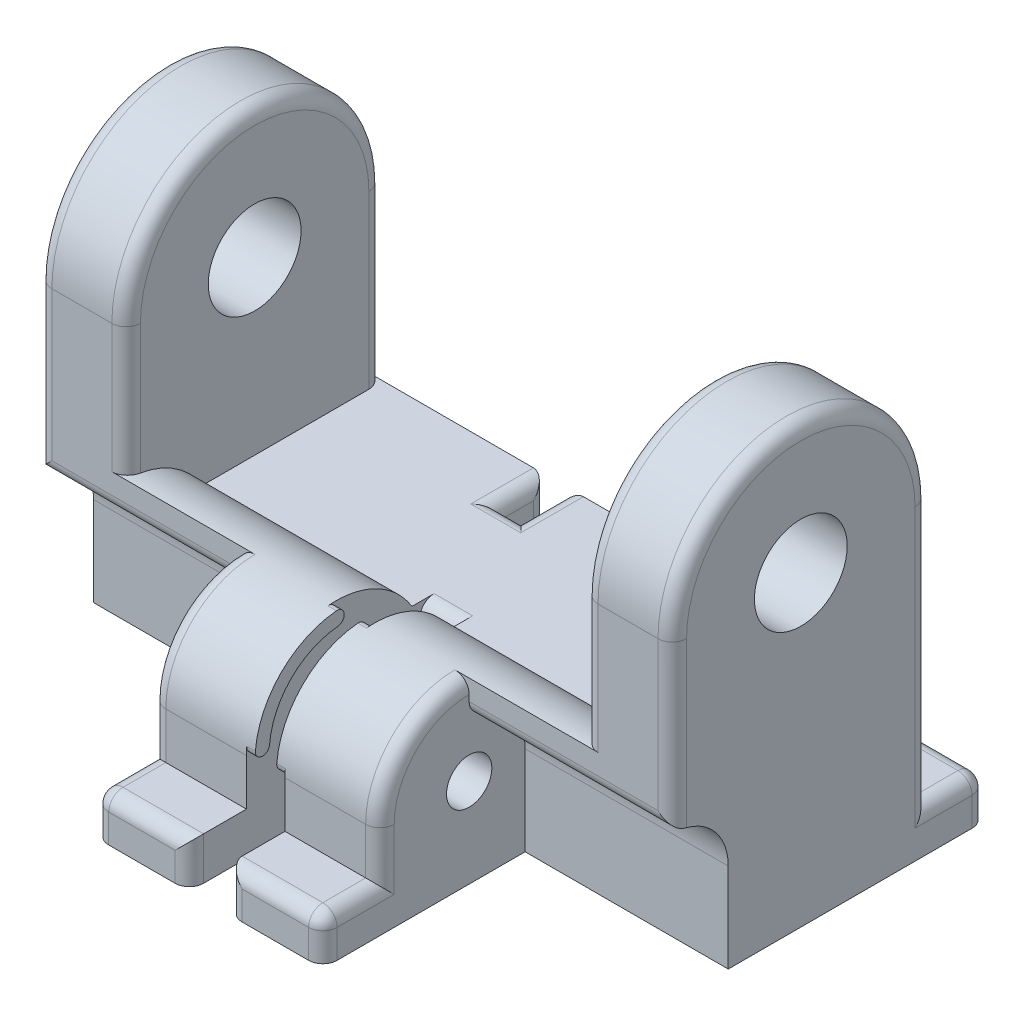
ISO-10303-21;
HEADER;
FILE_DESCRIPTION(('STEP AP214'),'2;1');
FILE_NAME('part.step','',(''),(''),'','','');
FILE_SCHEMA(('AUTOMOTIVE_DESIGN { 1 0 10303 214 1 1 1 1 }'));
ENDSEC;
DATA;
#1=APPLICATION_CONTEXT('core data for automotive mechanical design processes');
#2=APPLICATION_PROTOCOL_DEFINITION('international standard','automotive_design',2000,#1);
#3=PRODUCT_CONTEXT('',#1,'mechanical');
#4=PRODUCT('Part','Part','',(#3));
#5=PRODUCT_RELATED_PRODUCT_CATEGORY('part','',(#4));
#6=PRODUCT_DEFINITION_FORMATION('','',#4);
#7=PRODUCT_DEFINITION_CONTEXT('part definition',#1,'design');
#8=PRODUCT_DEFINITION('design','',#6,#7);
#9=PRODUCT_DEFINITION_SHAPE('','',#8);
#10=(LENGTH_UNIT() NAMED_UNIT(*) SI_UNIT(.MILLI.,.METRE.));
#11=(NAMED_UNIT(*) PLANE_ANGLE_UNIT() SI_UNIT($,.RADIAN.));
#12=(NAMED_UNIT(*) SI_UNIT($,.STERADIAN.) SOLID_ANGLE_UNIT());
#13=UNCERTAINTY_MEASURE_WITH_UNIT(LENGTH_MEASURE(1.E-05),#10,'distance_accuracy_value','');
#14=(GEOMETRIC_REPRESENTATION_CONTEXT(3) GLOBAL_UNCERTAINTY_ASSIGNED_CONTEXT((#13)) GLOBAL_UNIT_ASSIGNED_CONTEXT((#10,
#11,#12)) REPRESENTATION_CONTEXT('',''));
#15=CARTESIAN_POINT('',(0.,0.,0.));
#16=DIRECTION('',(0.,0.,1.));
#17=DIRECTION('',(1.,0.,0.));
#18=AXIS2_PLACEMENT_3D('',#15,#16,#17);
#19=CARTESIAN_POINT('',(22.225,21.5,-18.));
#20=DIRECTION('',(0.,0.,1.));
#21=DIRECTION('',(0.,-1.,0.));
#22=AXIS2_PLACEMENT_3D('',#19,#20,#21);
#23=PLANE('',#22);
#24=DIRECTION('',(-1.,0.,0.));
#25=VECTOR('',#24,1.);
#26=CARTESIAN_POINT('',(22.225,21.5,-18.));
#27=LINE('',#26,#25);
#28=CARTESIAN_POINT('',(-17.025,21.5,-18.));
#29=VERTEX_POINT('',#28);
#30=CARTESIAN_POINT('',(-21.225,21.5,-18.));
#31=VERTEX_POINT('',#30);
#32=EDGE_CURVE('E615',#29,#31,#27,.T.);
#33=ORIENTED_EDGE('',*,*,#32,.F.);
#34=DIRECTION('',(0.,1.,0.));
#35=VECTOR('',#34,1.);
#36=CARTESIAN_POINT('',(-17.025,9.5,-18.));
#37=LINE('',#36,#35);
#38=CARTESIAN_POINT('',(-17.025,9.5,-18.));
#39=VERTEX_POINT('',#38);
#40=EDGE_CURVE('E750',#29,#39,#37,.F.);
#41=ORIENTED_EDGE('',*,*,#40,.T.);
#42=DIRECTION('',(1.,0.,0.));
#43=VECTOR('',#42,1.);
#44=CARTESIAN_POINT('',(-15.875,9.5,-18.));
#45=LINE('',#44,#43);
#46=CARTESIAN_POINT('',(-5.5,9.5,-18.));
#47=VERTEX_POINT('',#46);
#48=EDGE_CURVE('E561',#39,#47,#45,.T.);
#49=ORIENTED_EDGE('',*,*,#48,.T.);
#50=DIRECTION('',(0.,1.,0.));
#51=VECTOR('',#50,1.);
#52=CARTESIAN_POINT('',(-5.5,6.,-18.));
#53=LINE('',#52,#51);
#54=CARTESIAN_POINT('',(-5.5,5.11251780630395,-18.));
#55=VERTEX_POINT('',#54);
#56=EDGE_CURVE('E746',#47,#55,#53,.F.);
#57=ORIENTED_EDGE('',*,*,#56,.T.);
#58=DIRECTION('',(1.,0.,0.));
#59=VECTOR('',#58,1.);
#60=CARTESIAN_POINT('',(-3.,5.11251780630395,-18.));
#61=LINE('',#60,#59);
#62=CARTESIAN_POINT('',(-2.,5.11251780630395,-18.));
#63=VERTEX_POINT('',#62);
#64=EDGE_CURVE('E743',#55,#63,#61,.T.);
#65=ORIENTED_EDGE('',*,*,#64,.T.);
#66=DIRECTION('',(0.,-1.,0.));
#67=VECTOR('',#66,1.);
#68=CARTESIAN_POINT('',(-2.,9.5,-18.));
#69=LINE('',#68,#67);
#70=CARTESIAN_POINT('',(-2.,9.5,-18.));
#71=VERTEX_POINT('',#70);
#72=EDGE_CURVE('E741',#63,#71,#69,.F.);
#73=ORIENTED_EDGE('',*,*,#72,.T.);
#74=CARTESIAN_POINT('',(17.025,9.5,-18.));
#75=VERTEX_POINT('',#74);
#76=EDGE_CURVE('E497',#71,#75,#45,.T.);
#77=ORIENTED_EDGE('',*,*,#76,.T.);
#78=DIRECTION('',(0.,1.,0.));
#79=VECTOR('',#78,1.);
#80=CARTESIAN_POINT('',(17.025,21.5,-18.));
#81=LINE('',#80,#79);
#82=CARTESIAN_POINT('',(17.025,21.5,-18.));
#83=VERTEX_POINT('',#82);
#84=EDGE_CURVE('E748',#75,#83,#81,.T.);
#85=ORIENTED_EDGE('',*,*,#84,.T.);
#86=CARTESIAN_POINT('',(21.225,21.5,-18.));
#87=VERTEX_POINT('',#86);
#88=EDGE_CURVE('E616',#87,#83,#27,.T.);
#89=ORIENTED_EDGE('',*,*,#88,.F.);
#90=DIRECTION('',(0.,1.,0.));
#91=VECTOR('',#90,1.);
#92=CARTESIAN_POINT('',(21.225,21.5,-18.));
#93=LINE('',#92,#91);
#94=CARTESIAN_POINT('',(21.225,3.,-18.));
#95=VERTEX_POINT('',#94);
#96=EDGE_CURVE('E737',#87,#95,#93,.F.);
#97=ORIENTED_EDGE('',*,*,#96,.T.);
#98=DIRECTION('',(-1.,0.,0.));
#99=VECTOR('',#98,1.);
#100=CARTESIAN_POINT('',(22.225,3.,-18.));
#101=LINE('',#100,#99);
#102=CARTESIAN_POINT('',(-21.225,3.,-18.));
#103=VERTEX_POINT('',#102);
#104=EDGE_CURVE('E619',#95,#103,#101,.T.);
#105=ORIENTED_EDGE('',*,*,#104,.T.);
#106=DIRECTION('',(0.,1.,0.));
#107=VECTOR('',#106,1.);
#108=CARTESIAN_POINT('',(-21.225,21.5,-18.));
#109=LINE('',#108,#107);
#110=EDGE_CURVE('E739',#103,#31,#109,.T.);
#111=ORIENTED_EDGE('',*,*,#110,.T.);
#112=EDGE_LOOP('',(#33,#41,#49,#57,#65,#73,#77,#85,#89,#97,#105,#111));
#113=FACE_BOUND('',#112,.T.);
#114=ADVANCED_FACE('F33',(#113),#23,.F.);
#115=CARTESIAN_POINT('',(-15.875,9.5,-5.33853912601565));
#116=DIRECTION('',(0.,-1.,0.));
#117=DIRECTION('',(0.,0.,-1.));
#118=AXIS2_PLACEMENT_3D('',#115,#116,#117);
#119=PLANE('',#118);
#120=DIRECTION('',(1.,0.,0.));
#121=VECTOR('',#120,1.);
#122=CARTESIAN_POINT('',(-4.5,9.5,-13.612517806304));
#123=LINE('',#122,#121);
#124=CARTESIAN_POINT('',(-2.,9.5,-13.612517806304));
#125=VERTEX_POINT('',#124);
#126=CARTESIAN_POINT('',(-5.5,9.5,-13.612517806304));
#127=VERTEX_POINT('',#126);
#128=EDGE_CURVE('E781',#125,#127,#123,.F.);
#129=ORIENTED_EDGE('',*,*,#128,.T.);
#130=DIRECTION('',(0.,0.,1.));
#131=VECTOR('',#130,1.);
#132=CARTESIAN_POINT('',(-5.5,9.5,-18.));
#133=LINE('',#132,#131);
#134=EDGE_CURVE('E783',#127,#47,#133,.F.);
#135=ORIENTED_EDGE('',*,*,#134,.T.);
#136=ORIENTED_EDGE('',*,*,#48,.F.);
#137=CARTESIAN_POINT('',(-17.025,9.5,-17.));
#138=DIRECTION('',(0.,-1.,0.));
#139=DIRECTION('',(0.,0.,-1.));
#140=AXIS2_PLACEMENT_3D('',#137,#138,#139);
#141=CIRCLE('',#140,1.);
#142=CARTESIAN_POINT('',(-16.025,9.5,-17.));
#143=VERTEX_POINT('',#142);
#144=EDGE_CURVE('E502',#39,#143,#141,.T.);
#145=ORIENTED_EDGE('',*,*,#144,.T.);
#146=DIRECTION('',(0.,0.,-1.));
#147=VECTOR('',#146,1.);
#148=CARTESIAN_POINT('',(-16.025,9.5,-5.33853912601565));
#149=LINE('',#148,#147);
#150=CARTESIAN_POINT('',(-16.025,9.5,-5.33853912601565));
#151=VERTEX_POINT('',#150);
#152=EDGE_CURVE('E483',#151,#143,#149,.T.);
#153=ORIENTED_EDGE('',*,*,#152,.F.);
#154=DIRECTION('',(1.,0.,0.));
#155=VECTOR('',#154,1.);
#156=CARTESIAN_POINT('',(-15.875,9.5,-5.33853912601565));
#157=LINE('',#156,#155);
#158=CARTESIAN_POINT('',(-1.35,9.5,-5.33853912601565));
#159=VERTEX_POINT('',#158);
#160=EDGE_CURVE('E492',#151,#159,#157,.T.);
#161=ORIENTED_EDGE('',*,*,#160,.T.);
#162=DIRECTION('',(0.,0.,-1.));
#163=VECTOR('',#162,1.);
#164=CARTESIAN_POINT('',(-1.35,9.5,0.));
#165=LINE('',#164,#163);
#166=CARTESIAN_POINT('',(-1.35,9.5,-6.89202437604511));
#167=VERTEX_POINT('',#166);
#168=EDGE_CURVE('E49',#159,#167,#165,.T.);
#169=ORIENTED_EDGE('',*,*,#168,.T.);
#170=DIRECTION('',(1.,0.,0.));
#171=VECTOR('',#170,1.);
#172=CARTESIAN_POINT('',(-15.875,9.5,-6.89202437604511));
#173=LINE('',#172,#171);
#174=CARTESIAN_POINT('',(1.35,9.5,-6.89202437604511));
#175=VERTEX_POINT('',#174);
#176=EDGE_CURVE('E774',#167,#175,#173,.T.);
#177=ORIENTED_EDGE('',*,*,#176,.T.);
#178=DIRECTION('',(0.,0.,1.));
#179=VECTOR('',#178,1.);
#180=CARTESIAN_POINT('',(1.35,9.5,-5.33853912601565));
#181=LINE('',#180,#179);
#182=CARTESIAN_POINT('',(1.35,9.5,-5.33853912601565));
#183=VERTEX_POINT('',#182);
#184=EDGE_CURVE('E777',#175,#183,#181,.T.);
#185=ORIENTED_EDGE('',*,*,#184,.T.);
#186=CARTESIAN_POINT('',(16.025,9.5,-5.33853912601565));
#187=VERTEX_POINT('',#186);
#188=EDGE_CURVE('E498',#183,#187,#157,.T.);
#189=ORIENTED_EDGE('',*,*,#188,.T.);
#190=DIRECTION('',(0.,0.,-1.));
#191=VECTOR('',#190,1.);
#192=CARTESIAN_POINT('',(16.025,9.5,-5.33853912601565));
#193=LINE('',#192,#191);
#194=CARTESIAN_POINT('',(16.025,9.5,-17.));
#195=VERTEX_POINT('',#194);
#196=EDGE_CURVE('E489',#187,#195,#193,.T.);
#197=ORIENTED_EDGE('',*,*,#196,.T.);
#198=CARTESIAN_POINT('',(17.025,9.5,-17.));
#199=DIRECTION('',(0.,-1.,0.));
#200=DIRECTION('',(0.,0.,-1.));
#201=AXIS2_PLACEMENT_3D('',#198,#199,#200);
#202=CIRCLE('',#201,1.);
#203=EDGE_CURVE('E1021',#195,#75,#202,.T.);
#204=ORIENTED_EDGE('',*,*,#203,.T.);
#205=ORIENTED_EDGE('',*,*,#76,.F.);
#206=DIRECTION('',(0.,0.,-1.));
#207=VECTOR('',#206,1.);
#208=CARTESIAN_POINT('',(-2.,9.5,-14.5));
#209=LINE('',#208,#207);
#210=EDGE_CURVE('E779',#71,#125,#209,.F.);
#211=ORIENTED_EDGE('',*,*,#210,.T.);
#212=EDGE_LOOP('',(#129,#135,#136,#145,#153,#161,#169,#177,#185,#189,#197,#204,#205,#211));
#213=FACE_BOUND('',#212,.T.);
#214=ADVANCED_FACE('F500',(#213),#119,.F.);
#215=CARTESIAN_POINT('',(22.225,6.25,0.));
#216=DIRECTION('',(-1.,0.,0.));
#217=DIRECTION('',(0.,0.,1.));
#218=AXIS2_PLACEMENT_3D('',#215,#216,#217);
#219=CYLINDRICAL_SURFACE('',#218,6.25);
#220=DIRECTION('',(-1.,0.,0.));
#221=VECTOR('',#220,1.);
#222=CARTESIAN_POINT('',(22.225,6.25,6.25));
#223=LINE('',#222,#221);
#224=CARTESIAN_POINT('',(7.,6.25,6.25));
#225=VERTEX_POINT('',#224);
#226=CARTESIAN_POINT('',(1.35,6.25,6.25));
#227=VERTEX_POINT('',#226);
#228=EDGE_CURVE('E633',#225,#227,#223,.T.);
#229=ORIENTED_EDGE('',*,*,#228,.F.);
#230=CARTESIAN_POINT('',(7.,6.25,0.));
#231=DIRECTION('',(1.,0.,0.));
#232=DIRECTION('',(0.,0.,-1.));
#233=AXIS2_PLACEMENT_3D('',#230,#231,#232);
#234=CIRCLE('',#233,6.25);
#235=CARTESIAN_POINT('',(7.,12.5,0.));
#236=VERTEX_POINT('',#235);
#237=EDGE_CURVE('E802',#225,#236,#234,.F.);
#238=ORIENTED_EDGE('',*,*,#237,.T.);
#239=DIRECTION('',(1.,0.,0.));
#240=VECTOR('',#239,1.);
#241=CARTESIAN_POINT('',(8.,12.5,0.));
#242=LINE('',#241,#240);
#243=CARTESIAN_POINT('',(17.025,12.5,0.));
#244=VERTEX_POINT('',#243);
#245=EDGE_CURVE('E559',#236,#244,#242,.T.);
#246=ORIENTED_EDGE('',*,*,#245,.T.);
#247=CARTESIAN_POINT('',(17.025,12.5,0.));
#248=CARTESIAN_POINT('',(16.9968723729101,12.4999989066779,-1.88012767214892E-07));
#249=CARTESIAN_POINT('',(16.9687582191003,12.500000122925,-0.00118748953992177));
#250=CARTESIAN_POINT('',(16.9127309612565,12.4999978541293,-0.00592412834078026));
#251=CARTESIAN_POINT('',(16.8848178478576,12.4999943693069,-0.00947335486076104));
#252=CARTESIAN_POINT('',(16.8017262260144,12.4999629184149,-0.0236306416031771));
#253=CARTESIAN_POINT('',(16.7471040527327,12.4999140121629,-0.0377483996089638));
#254=CARTESIAN_POINT('',(16.6410055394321,12.4995779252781,-0.0749516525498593));
#255=CARTESIAN_POINT('',(16.589530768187,12.4992906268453,-0.0980415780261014));
#256=CARTESIAN_POINT('',(16.4911919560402,12.4981976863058,-0.152529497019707));
#257=CARTESIAN_POINT('',(16.4443271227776,12.4973921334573,-0.183926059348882));
#258=CARTESIAN_POINT('',(16.3565931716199,12.4949312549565,-0.254088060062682));
#259=CARTESIAN_POINT('',(16.3157176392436,12.4932768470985,-0.292845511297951));
#260=CARTESIAN_POINT('',(16.241062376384,12.4887823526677,-0.3766305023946));
#261=CARTESIAN_POINT('',(16.2072832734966,12.4859421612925,-0.421658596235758));
#262=CARTESIAN_POINT('',(16.1479107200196,12.4788069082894,-0.516440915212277));
#263=CARTESIAN_POINT('',(16.1222826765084,12.4745181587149,-0.566173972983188));
#264=CARTESIAN_POINT('',(16.079708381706,12.4642997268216,-0.669062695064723));
#265=CARTESIAN_POINT('',(16.0627585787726,12.4583707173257,-0.722216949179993));
#266=CARTESIAN_POINT('',(16.0419020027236,12.4469998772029,-0.813061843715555));
#267=CARTESIAN_POINT('',(16.0355584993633,12.4420072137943,-0.850269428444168));
#268=CARTESIAN_POINT('',(16.0271075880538,12.4312873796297,-0.924999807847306));
#269=CARTESIAN_POINT('',(16.0249937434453,12.4255613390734,-0.962522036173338));
#270=CARTESIAN_POINT('',(16.025,12.4194813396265,-1.));
#271=B_SPLINE_CURVE_WITH_KNOTS('',3,(#247,#248,#249,#250,#251,#252,#253,#254,#255,#256,#257,
#258,#259,#260,#261,#262,#263,#264,#265,#266,#267,#268,#269,#270),.UNSPECIFIED.,.F.,.F.,(4,2,2,
2,2,2,2,2,2,2,2,4),(0.,0.084331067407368,0.168658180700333,0.337041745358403,0.505508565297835,
0.673946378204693,0.842202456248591,1.0104734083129,1.17802038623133,1.34549873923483,
1.45948875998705,1.57330517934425),.UNSPECIFIED.);
#272=CARTESIAN_POINT('',(16.025,12.4194813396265,-1.));
#273=VERTEX_POINT('',#272);
#274=EDGE_CURVE('E1015',#244,#273,#271,.T.);
#275=ORIENTED_EDGE('',*,*,#274,.T.);
#276=CARTESIAN_POINT('',(16.025,6.25,0.));
#277=DIRECTION('',(-1.,0.,0.));
#278=DIRECTION('',(0.,0.,-1.));
#279=AXIS2_PLACEMENT_3D('',#276,#277,#278);
#280=CIRCLE('',#279,6.25);
#281=EDGE_CURVE('E510',#273,#187,#280,.T.);
#282=ORIENTED_EDGE('',*,*,#281,.T.);
#283=ORIENTED_EDGE('',*,*,#188,.F.);
#284=CARTESIAN_POINT('',(1.35,6.25,0.));
#285=DIRECTION('',(1.,0.,0.));
#286=DIRECTION('',(0.,0.,1.));
#287=AXIS2_PLACEMENT_3D('',#284,#285,#286);
#288=CIRCLE('',#287,6.25);
#289=CARTESIAN_POINT('',(1.35,12.4763256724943,0.543478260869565));
#290=VERTEX_POINT('',#289);
#291=EDGE_CURVE('E589',#183,#290,#288,.T.);
#292=ORIENTED_EDGE('',*,*,#291,.T.);
#293=DIRECTION('',(-1.,0.,0.));
#294=VECTOR('',#293,1.);
#295=CARTESIAN_POINT('',(22.225,12.4763256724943,0.543478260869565));
#296=LINE('',#295,#294);
#297=CARTESIAN_POINT('',(0.750000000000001,12.4763256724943,0.543478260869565));
#298=VERTEX_POINT('',#297);
#299=EDGE_CURVE('E667',#290,#298,#296,.T.);
#300=ORIENTED_EDGE('',*,*,#299,.T.);
#301=CARTESIAN_POINT('',(0.750000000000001,6.25,0.));
#302=DIRECTION('',(1.,0.,0.));
#303=DIRECTION('',(0.,0.,-1.));
#304=AXIS2_PLACEMENT_3D('',#301,#302,#303);
#305=CIRCLE('',#304,6.25);
#306=CARTESIAN_POINT('',(0.750000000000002,6.79347826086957,6.22632567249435));
#307=VERTEX_POINT('',#306);
#308=EDGE_CURVE('E1382',#298,#307,#305,.T.);
#309=ORIENTED_EDGE('',*,*,#308,.T.);
#310=DIRECTION('',(-1.,0.,0.));
#311=VECTOR('',#310,1.);
#312=CARTESIAN_POINT('',(22.225,6.79347826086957,6.22632567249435));
#313=LINE('',#312,#311);
#314=CARTESIAN_POINT('',(1.35,6.79347826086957,6.22632567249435));
#315=VERTEX_POINT('',#314);
#316=EDGE_CURVE('E664',#307,#315,#313,.F.);
#317=ORIENTED_EDGE('',*,*,#316,.T.);
#318=CARTESIAN_POINT('',(1.35,6.25,0.));
#319=DIRECTION('',(1.,0.,0.));
#320=DIRECTION('',(0.,0.,-1.));
#321=AXIS2_PLACEMENT_3D('',#318,#319,#320);
#322=CIRCLE('',#321,6.25);
#323=EDGE_CURVE('E661',#315,#227,#322,.T.);
#324=ORIENTED_EDGE('',*,*,#323,.T.);
#325=EDGE_LOOP('',(#229,#238,#246,#275,#282,#283,#292,#300,#309,#317,#324));
#326=FACE_BOUND('',#325,.T.);
#327=ADVANCED_FACE('F925',(#326),#219,.T.);
#328=CARTESIAN_POINT('',(10.1888347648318,6.25,0.));
#329=DIRECTION('',(-1.,0.,0.));
#330=DIRECTION('',(0.,0.,1.));
#331=AXIS2_PLACEMENT_3D('',#328,#329,#330);
#332=CYLINDRICAL_SURFACE('',#331,5.25);
#333=CARTESIAN_POINT('',(0.749999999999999,6.25,0.));
#334=DIRECTION('',(1.,0.,0.));
#335=DIRECTION('',(0.,0.,-1.));
#336=AXIS2_PLACEMENT_3D('',#333,#334,#335);
#337=CIRCLE('',#336,5.25);
#338=CARTESIAN_POINT('',(0.75,6.70652173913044,5.23011356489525));
#339=VERTEX_POINT('',#338);
#340=CARTESIAN_POINT('',(0.749999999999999,11.4801135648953,0.456521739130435));
#341=VERTEX_POINT('',#340);
#342=EDGE_CURVE('E1377',#339,#341,#337,.F.);
#343=ORIENTED_EDGE('',*,*,#342,.T.);
#344=DIRECTION('',(-1.,0.,0.));
#345=VECTOR('',#344,1.);
#346=CARTESIAN_POINT('',(10.1888347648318,11.4801135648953,0.456521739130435));
#347=LINE('',#346,#345);
#348=CARTESIAN_POINT('',(1.35,11.4801135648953,0.456521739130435));
#349=VERTEX_POINT('',#348);
#350=EDGE_CURVE('E658',#341,#349,#347,.F.);
#351=ORIENTED_EDGE('',*,*,#350,.T.);
#352=CARTESIAN_POINT('',(1.35,6.25,0.));
#353=DIRECTION('',(1.,0.,0.));
#354=DIRECTION('',(0.,0.,-1.));
#355=AXIS2_PLACEMENT_3D('',#352,#353,#354);
#356=CIRCLE('',#355,5.25);
#357=CARTESIAN_POINT('',(1.35,6.70652173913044,5.23011356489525));
#358=VERTEX_POINT('',#357);
#359=EDGE_CURVE('E512',#358,#349,#356,.F.);
#360=ORIENTED_EDGE('',*,*,#359,.F.);
#361=DIRECTION('',(-1.,0.,0.));
#362=VECTOR('',#361,1.);
#363=CARTESIAN_POINT('',(10.1888347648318,6.70652173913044,5.23011356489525));
#364=LINE('',#363,#362);
#365=EDGE_CURVE('E655',#358,#339,#364,.T.);
#366=ORIENTED_EDGE('',*,*,#365,.T.);
#367=EDGE_LOOP('',(#343,#351,#360,#366));
#368=FACE_BOUND('',#367,.T.);
#369=ADVANCED_FACE('F930',(#368),#332,.F.);
#370=CARTESIAN_POINT('',(-1.35,6.25,0.));
#371=DIRECTION('',(1.,0.,0.));
#372=DIRECTION('',(0.,0.,-1.));
#373=AXIS2_PLACEMENT_3D('',#370,#371,#372);
#374=PLANE('',#373);
#375=CARTESIAN_POINT('',(-1.35,6.25,0.));
#376=DIRECTION('',(1.,0.,0.));
#377=DIRECTION('',(0.,0.,-1.));
#378=AXIS2_PLACEMENT_3D('',#375,#376,#377);
#379=CIRCLE('',#378,1.5875);
#380=CARTESIAN_POINT('',(-1.35,6.25,-1.5875));
#381=VERTEX_POINT('',#380);
#382=EDGE_CURVE('E605',#381,#381,#379,.T.);
#383=ORIENTED_EDGE('',*,*,#382,.F.);
#384=EDGE_LOOP('',(#383));
#385=FACE_BOUND('',#384,.T.);
#386=DIRECTION('',(0.,0.,1.));
#387=VECTOR('',#386,1.);
#388=CARTESIAN_POINT('',(-1.35,3.,6.25));
#389=LINE('',#388,#387);
#390=CARTESIAN_POINT('',(-1.35,3.,6.25));
#391=VERTEX_POINT('',#390);
#392=CARTESIAN_POINT('',(-1.35,3.,9.25));
#393=VERTEX_POINT('',#392);
#394=EDGE_CURVE('E570',#391,#393,#389,.T.);
#395=ORIENTED_EDGE('',*,*,#394,.T.);
#396=DIRECTION('',(0.,-1.,0.));
#397=VECTOR('',#396,1.);
#398=CARTESIAN_POINT('',(-1.35,0.,9.25));
#399=LINE('',#398,#397);
#400=CARTESIAN_POINT('',(-1.35,0.,9.25));
#401=VERTEX_POINT('',#400);
#402=EDGE_CURVE('E1241',#393,#401,#399,.T.);
#403=ORIENTED_EDGE('',*,*,#402,.T.);
#404=DIRECTION('',(0.,0.,-1.));
#405=VECTOR('',#404,1.);
#406=CARTESIAN_POINT('',(-1.35,0.,10.25));
#407=LINE('',#406,#405);
#408=CARTESIAN_POINT('',(-1.35,0.,-6.25));
#409=VERTEX_POINT('',#408);
#410=EDGE_CURVE('E573',#401,#409,#407,.T.);
#411=ORIENTED_EDGE('',*,*,#410,.T.);
#412=DIRECTION('',(0.,1.,0.));
#413=VECTOR('',#412,1.);
#414=CARTESIAN_POINT('',(-1.35,6.25,-6.25));
#415=LINE('',#414,#413);
#416=CARTESIAN_POINT('',(-1.35,6.25,-6.25));
#417=VERTEX_POINT('',#416);
#418=EDGE_CURVE('E575',#409,#417,#415,.T.);
#419=ORIENTED_EDGE('',*,*,#418,.T.);
#420=CARTESIAN_POINT('',(-1.35,6.25,0.));
#421=DIRECTION('',(1.,0.,0.));
#422=DIRECTION('',(0.,0.,-1.));
#423=AXIS2_PLACEMENT_3D('',#420,#421,#422);
#424=CIRCLE('',#423,6.25);
#425=CARTESIAN_POINT('',(-1.35,8.18965517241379,-5.94140032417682));
#426=VERTEX_POINT('',#425);
#427=EDGE_CURVE('E565',#417,#426,#424,.T.);
#428=ORIENTED_EDGE('',*,*,#427,.T.);
#429=CARTESIAN_POINT('',(-1.35,8.5,-6.89202437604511));
#430=DIRECTION('',(1.,0.,0.));
#431=DIRECTION('',(0.,0.,-1.));
#432=AXIS2_PLACEMENT_3D('',#429,#430,#431);
#433=CIRCLE('',#432,1.);
#434=EDGE_CURVE('E11',#426,#167,#433,.F.);
#435=ORIENTED_EDGE('',*,*,#434,.T.);
#436=ORIENTED_EDGE('',*,*,#168,.F.);
#437=CARTESIAN_POINT('',(-1.35,12.4763256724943,0.543478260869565));
#438=VERTEX_POINT('',#437);
#439=EDGE_CURVE('E495',#159,#438,#424,.T.);
#440=ORIENTED_EDGE('',*,*,#439,.T.);
#441=CARTESIAN_POINT('',(-1.35,11.9782196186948,0.5));
#442=DIRECTION('',(1.,0.,0.));
#443=DIRECTION('',(0.,0.,-1.));
#444=AXIS2_PLACEMENT_3D('',#441,#442,#443);
#445=CIRCLE('',#444,0.5);
#446=CARTESIAN_POINT('',(-1.35,11.9782196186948,0.));
#447=VERTEX_POINT('',#446);
#448=EDGE_CURVE('E697',#438,#447,#445,.F.);
#449=ORIENTED_EDGE('',*,*,#448,.T.);
#450=CARTESIAN_POINT('',(-1.35,11.9782196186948,0.5));
#451=DIRECTION('',(1.,0.,0.));
#452=DIRECTION('',(0.,0.,-1.));
#453=AXIS2_PLACEMENT_3D('',#450,#451,#452);
#454=CIRCLE('',#453,0.5);
#455=CARTESIAN_POINT('',(-1.35,11.4801135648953,0.456521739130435));
#456=VERTEX_POINT('',#455);
#457=EDGE_CURVE('E695',#447,#456,#454,.F.);
#458=ORIENTED_EDGE('',*,*,#457,.T.);
#459=CARTESIAN_POINT('',(-1.35,6.25,0.));
#460=DIRECTION('',(1.,0.,0.));
#461=DIRECTION('',(0.,0.,-1.));
#462=AXIS2_PLACEMENT_3D('',#459,#460,#461);
#463=CIRCLE('',#462,5.25);
#464=CARTESIAN_POINT('',(-1.35,6.70652173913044,5.23011356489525));
#465=VERTEX_POINT('',#464);
#466=EDGE_CURVE('E1385',#456,#465,#463,.T.);
#467=ORIENTED_EDGE('',*,*,#466,.T.);
#468=CARTESIAN_POINT('',(-1.35,6.75,5.7282196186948));
#469=DIRECTION('',(1.,0.,0.));
#470=DIRECTION('',(0.,0.,-1.));
#471=AXIS2_PLACEMENT_3D('',#468,#469,#470);
#472=CIRCLE('',#471,0.5);
#473=CARTESIAN_POINT('',(-1.35,6.25,5.7282196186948));
#474=VERTEX_POINT('',#473);
#475=EDGE_CURVE('E703',#465,#474,#472,.F.);
#476=ORIENTED_EDGE('',*,*,#475,.T.);
#477=CARTESIAN_POINT('',(-1.35,6.75,5.7282196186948));
#478=DIRECTION('',(1.,0.,0.));
#479=DIRECTION('',(0.,0.,-1.));
#480=AXIS2_PLACEMENT_3D('',#477,#478,#479);
#481=CIRCLE('',#480,0.5);
#482=CARTESIAN_POINT('',(-1.35,6.79347826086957,6.22632567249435));
#483=VERTEX_POINT('',#482);
#484=EDGE_CURVE('E705',#474,#483,#481,.F.);
#485=ORIENTED_EDGE('',*,*,#484,.T.);
#486=CARTESIAN_POINT('',(-1.35,6.25,0.));
#487=DIRECTION('',(1.,0.,0.));
#488=DIRECTION('',(0.,0.,-1.));
#489=AXIS2_PLACEMENT_3D('',#486,#487,#488);
#490=CIRCLE('',#489,6.25);
#491=CARTESIAN_POINT('',(-1.35,6.25,6.25));
#492=VERTEX_POINT('',#491);
#493=EDGE_CURVE('E685',#492,#483,#490,.F.);
#494=ORIENTED_EDGE('',*,*,#493,.F.);
#495=DIRECTION('',(0.,-1.,0.));
#496=VECTOR('',#495,1.);
#497=CARTESIAN_POINT('',(-1.35,6.25,6.25));
#498=LINE('',#497,#496);
#499=EDGE_CURVE('E568',#492,#391,#498,.T.);
#500=ORIENTED_EDGE('',*,*,#499,.T.);
#501=EDGE_LOOP('',(#395,#403,#411,#419,#428,#435,#436,#440,#449,#458,#467,#476,#485,#494,#500));
#502=FACE_BOUND('',#501,.T.);
#503=ADVANCED_FACE('F926',(#385,#502),#374,.T.);
#504=CARTESIAN_POINT('',(1.35,6.25,0.));
#505=DIRECTION('',(1.,0.,0.));
#506=DIRECTION('',(0.,0.,-1.));
#507=AXIS2_PLACEMENT_3D('',#504,#505,#506);
#508=PLANE('',#507);
#509=CARTESIAN_POINT('',(1.35,6.25,0.));
#510=DIRECTION('',(1.,0.,0.));
#511=DIRECTION('',(0.,0.,-1.));
#512=AXIS2_PLACEMENT_3D('',#509,#510,#511);
#513=CIRCLE('',#512,1.5875);
#514=CARTESIAN_POINT('',(1.35,6.25,-1.5875));
#515=VERTEX_POINT('',#514);
#516=EDGE_CURVE('E595',#515,#515,#513,.T.);
#517=ORIENTED_EDGE('',*,*,#516,.T.);
#518=EDGE_LOOP('',(#517));
#519=FACE_BOUND('',#518,.T.);
#520=DIRECTION('',(0.,0.,-1.));
#521=VECTOR('',#520,1.);
#522=CARTESIAN_POINT('',(1.35,0.,10.25));
#523=LINE('',#522,#521);
#524=CARTESIAN_POINT('',(1.35,0.,9.25));
#525=VERTEX_POINT('',#524);
#526=CARTESIAN_POINT('',(1.35,0.,-6.25));
#527=VERTEX_POINT('',#526);
#528=EDGE_CURVE('E584',#525,#527,#523,.T.);
#529=ORIENTED_EDGE('',*,*,#528,.F.);
#530=DIRECTION('',(0.,-1.,0.));
#531=VECTOR('',#530,1.);
#532=CARTESIAN_POINT('',(1.35,6.25,9.25));
#533=LINE('',#532,#531);
#534=CARTESIAN_POINT('',(1.35,3.,9.25));
#535=VERTEX_POINT('',#534);
#536=EDGE_CURVE('E1245',#525,#535,#533,.F.);
#537=ORIENTED_EDGE('',*,*,#536,.T.);
#538=DIRECTION('',(0.,0.,1.));
#539=VECTOR('',#538,1.);
#540=CARTESIAN_POINT('',(1.35,3.,6.25));
#541=LINE('',#540,#539);
#542=CARTESIAN_POINT('',(1.35,3.,6.25));
#543=VERTEX_POINT('',#542);
#544=EDGE_CURVE('E581',#543,#535,#541,.T.);
#545=ORIENTED_EDGE('',*,*,#544,.F.);
#546=DIRECTION('',(0.,-1.,0.));
#547=VECTOR('',#546,1.);
#548=CARTESIAN_POINT('',(1.35,6.25,6.25));
#549=LINE('',#548,#547);
#550=EDGE_CURVE('E563',#227,#543,#549,.T.);
#551=ORIENTED_EDGE('',*,*,#550,.F.);
#552=ORIENTED_EDGE('',*,*,#323,.F.);
#553=CARTESIAN_POINT('',(1.35,6.75,5.7282196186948));
#554=DIRECTION('',(1.,0.,0.));
#555=DIRECTION('',(0.,0.,-1.));
#556=AXIS2_PLACEMENT_3D('',#553,#554,#555);
#557=CIRCLE('',#556,0.5);
#558=CARTESIAN_POINT('',(1.35,6.25,5.7282196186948));
#559=VERTEX_POINT('',#558);
#560=EDGE_CURVE('E701',#315,#559,#557,.T.);
#561=ORIENTED_EDGE('',*,*,#560,.T.);
#562=CARTESIAN_POINT('',(1.35,6.75,5.7282196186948));
#563=DIRECTION('',(1.,0.,0.));
#564=DIRECTION('',(0.,0.,-1.));
#565=AXIS2_PLACEMENT_3D('',#562,#563,#564);
#566=CIRCLE('',#565,0.5);
#567=EDGE_CURVE('E699',#559,#358,#566,.T.);
#568=ORIENTED_EDGE('',*,*,#567,.T.);
#569=ORIENTED_EDGE('',*,*,#359,.T.);
#570=CARTESIAN_POINT('',(1.35,11.9782196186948,0.5));
#571=DIRECTION('',(1.,0.,0.));
#572=DIRECTION('',(0.,0.,-1.));
#573=AXIS2_PLACEMENT_3D('',#570,#571,#572);
#574=CIRCLE('',#573,0.5);
#575=CARTESIAN_POINT('',(1.35,11.9782196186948,0.));
#576=VERTEX_POINT('',#575);
#577=EDGE_CURVE('E690',#349,#576,#574,.T.);
#578=ORIENTED_EDGE('',*,*,#577,.T.);
#579=CARTESIAN_POINT('',(1.35,11.9782196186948,0.5));
#580=DIRECTION('',(1.,0.,0.));
#581=DIRECTION('',(0.,0.,-1.));
#582=AXIS2_PLACEMENT_3D('',#579,#580,#581);
#583=CIRCLE('',#582,0.5);
#584=EDGE_CURVE('E692',#576,#290,#583,.T.);
#585=ORIENTED_EDGE('',*,*,#584,.T.);
#586=ORIENTED_EDGE('',*,*,#291,.F.);
#587=ORIENTED_EDGE('',*,*,#184,.F.);
#588=CARTESIAN_POINT('',(1.35,8.5,-6.89202437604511));
#589=DIRECTION('',(1.,0.,0.));
#590=DIRECTION('',(0.,0.,-1.));
#591=AXIS2_PLACEMENT_3D('',#588,#589,#590);
#592=CIRCLE('',#591,1.);
#593=CARTESIAN_POINT('',(1.35,8.18965517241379,-5.94140032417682));
#594=VERTEX_POINT('',#593);
#595=EDGE_CURVE('E42',#175,#594,#592,.T.);
#596=ORIENTED_EDGE('',*,*,#595,.T.);
#597=CARTESIAN_POINT('',(1.35,6.25,-6.25));
#598=VERTEX_POINT('',#597);
#599=EDGE_CURVE('E590',#598,#594,#288,.T.);
#600=ORIENTED_EDGE('',*,*,#599,.F.);
#601=DIRECTION('',(0.,1.,0.));
#602=VECTOR('',#601,1.);
#603=CARTESIAN_POINT('',(1.35,6.25,-6.25));
#604=LINE('',#603,#602);
#605=EDGE_CURVE('E586',#527,#598,#604,.T.);
#606=ORIENTED_EDGE('',*,*,#605,.F.);
#607=EDGE_LOOP('',(#529,#537,#545,#551,#552,#561,#568,#569,#578,#585,#586,#587,#596,#600,#606));
#608=FACE_BOUND('',#607,.T.);
#609=ADVANCED_FACE('F929',(#519,#608),#508,.F.);
#610=CARTESIAN_POINT('',(22.225,21.5,-9.));
#611=DIRECTION('',(-1.,0.,0.));
#612=DIRECTION('',(0.,0.,1.));
#613=AXIS2_PLACEMENT_3D('',#610,#611,#612);
#614=CYLINDRICAL_SURFACE('',#613,9.);
#615=DIRECTION('',(-1.,0.,0.));
#616=VECTOR('',#615,1.);
#617=CARTESIAN_POINT('',(22.225,21.5,0.));
#618=LINE('',#617,#616);
#619=CARTESIAN_POINT('',(-17.025,21.5,0.));
#620=VERTEX_POINT('',#619);
#621=CARTESIAN_POINT('',(-21.225,21.5,0.));
#622=VERTEX_POINT('',#621);
#623=EDGE_CURVE('E609',#620,#622,#618,.T.);
#624=ORIENTED_EDGE('',*,*,#623,.F.);
#625=CARTESIAN_POINT('',(-17.025,21.5,-9.));
#626=DIRECTION('',(1.,0.,0.));
#627=DIRECTION('',(0.,0.,-1.));
#628=AXIS2_PLACEMENT_3D('',#625,#626,#627);
#629=CIRCLE('',#628,9.);
#630=EDGE_CURVE('E735',#620,#29,#629,.F.);
#631=ORIENTED_EDGE('',*,*,#630,.T.);
#632=ORIENTED_EDGE('',*,*,#32,.T.);
#633=CARTESIAN_POINT('',(-21.225,21.5,-9.));
#634=DIRECTION('',(-1.,0.,0.));
#635=DIRECTION('',(0.,0.,1.));
#636=AXIS2_PLACEMENT_3D('',#633,#634,#635);
#637=CIRCLE('',#636,9.);
#638=EDGE_CURVE('E733',#31,#622,#637,.F.);
#639=ORIENTED_EDGE('',*,*,#638,.T.);
#640=EDGE_LOOP('',(#624,#631,#632,#639));
#641=FACE_BOUND('',#640,.T.);
#642=ADVANCED_FACE('F934',(#641),#614,.T.);
#643=CARTESIAN_POINT('',(22.225,21.5,-9.));
#644=DIRECTION('',(-1.,0.,0.));
#645=DIRECTION('',(0.,0.,1.));
#646=AXIS2_PLACEMENT_3D('',#643,#644,#645);
#647=CYLINDRICAL_SURFACE('',#646,3.25000000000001);
#648=CARTESIAN_POINT('',(-22.225,21.5,-9.));
#649=DIRECTION('',(1.,0.,0.));
#650=DIRECTION('',(0.,0.,-1.));
#651=AXIS2_PLACEMENT_3D('',#648,#649,#650);
#652=CIRCLE('',#651,3.25000000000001);
#653=CARTESIAN_POINT('',(-22.225,21.5,-12.25));
#654=VERTEX_POINT('',#653);
#655=EDGE_CURVE('E602',#654,#654,#652,.T.);
#656=ORIENTED_EDGE('',*,*,#655,.F.);
#657=EDGE_LOOP('',(#656));
#658=FACE_BOUND('',#657,.T.);
#659=CARTESIAN_POINT('',(-16.025,21.5,-9.));
#660=DIRECTION('',(1.,0.,0.));
#661=DIRECTION('',(0.,0.,-1.));
#662=AXIS2_PLACEMENT_3D('',#659,#660,#661);
#663=CIRCLE('',#662,3.25000000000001);
#664=CARTESIAN_POINT('',(-16.025,21.5,-12.25));
#665=VERTEX_POINT('',#664);
#666=EDGE_CURVE('E506',#665,#665,#663,.T.);
#667=ORIENTED_EDGE('',*,*,#666,.T.);
#668=EDGE_LOOP('',(#667));
#669=FACE_BOUND('',#668,.T.);
#670=ADVANCED_FACE('F948',(#658,#669),#647,.F.);
#671=CARTESIAN_POINT('',(22.225,0.,10.25));
#672=DIRECTION('',(0.,1.,0.));
#673=DIRECTION('',(0.,0.,1.));
#674=AXIS2_PLACEMENT_3D('',#671,#672,#673);
#675=PLANE('',#674);
#676=DIRECTION('',(-1.,0.,0.));
#677=VECTOR('',#676,1.);
#678=CARTESIAN_POINT('',(22.225,0.,-22.));
#679=LINE('',#678,#677);
#680=CARTESIAN_POINT('',(21.225,0.,-22.));
#681=VERTEX_POINT('',#680);
#682=CARTESIAN_POINT('',(-21.225,0.,-22.));
#683=VERTEX_POINT('',#682);
#684=EDGE_CURVE('E622',#681,#683,#679,.T.);
#685=ORIENTED_EDGE('',*,*,#684,.F.);
#686=CARTESIAN_POINT('',(21.225,0.,-21.));
#687=DIRECTION('',(0.,1.,0.));
#688=DIRECTION('',(0.,0.,1.));
#689=AXIS2_PLACEMENT_3D('',#686,#687,#688);
#690=CIRCLE('',#689,1.);
#691=CARTESIAN_POINT('',(22.225,0.,-21.));
#692=VERTEX_POINT('',#691);
#693=EDGE_CURVE('E1522',#681,#692,#690,.F.);
#694=ORIENTED_EDGE('',*,*,#693,.T.);
#695=DIRECTION('',(0.,0.,-1.));
#696=VECTOR('',#695,1.);
#697=CARTESIAN_POINT('',(22.225,0.,10.25));
#698=LINE('',#697,#696);
#699=CARTESIAN_POINT('',(22.225,0.,-3.91875));
#700=VERTEX_POINT('',#699);
#701=EDGE_CURVE('E606',#700,#692,#698,.T.);
#702=ORIENTED_EDGE('',*,*,#701,.F.);
#703=DIRECTION('',(-1.,0.,0.));
#704=VECTOR('',#703,1.);
#705=CARTESIAN_POINT('',(35.0636090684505,0.,-3.91875));
#706=LINE('',#705,#704);
#707=CARTESIAN_POINT('',(8.,0.,-3.91875));
#708=VERTEX_POINT('',#707);
#709=EDGE_CURVE('E542',#700,#708,#706,.T.);
#710=ORIENTED_EDGE('',*,*,#709,.T.);
#711=DIRECTION('',(0.,0.,-1.));
#712=VECTOR('',#711,1.);
#713=CARTESIAN_POINT('',(8.,0.,0.));
#714=LINE('',#713,#712);
#715=CARTESIAN_POINT('',(8.,0.,9.25));
#716=VERTEX_POINT('',#715);
#717=EDGE_CURVE('E554',#716,#708,#714,.T.);
#718=ORIENTED_EDGE('',*,*,#717,.F.);
#719=CARTESIAN_POINT('',(7.,0.,9.25));
#720=DIRECTION('',(0.,1.,0.));
#721=DIRECTION('',(0.,0.,1.));
#722=AXIS2_PLACEMENT_3D('',#719,#720,#721);
#723=CIRCLE('',#722,1.);
#724=CARTESIAN_POINT('',(7.,0.,10.25));
#725=VERTEX_POINT('',#724);
#726=EDGE_CURVE('E1528',#716,#725,#723,.F.);
#727=ORIENTED_EDGE('',*,*,#726,.T.);
#728=DIRECTION('',(-1.,0.,0.));
#729=VECTOR('',#728,1.);
#730=CARTESIAN_POINT('',(22.225,0.,10.25));
#731=LINE('',#730,#729);
#732=CARTESIAN_POINT('',(2.35,0.,10.25));
#733=VERTEX_POINT('',#732);
#734=EDGE_CURVE('E628',#725,#733,#731,.T.);
#735=ORIENTED_EDGE('',*,*,#734,.T.);
#736=CARTESIAN_POINT('',(2.35,0.,9.25));
#737=DIRECTION('',(0.,1.,0.));
#738=DIRECTION('',(0.,0.,1.));
#739=AXIS2_PLACEMENT_3D('',#736,#737,#738);
#740=CIRCLE('',#739,1.);
#741=EDGE_CURVE('E1328',#733,#525,#740,.F.);
#742=ORIENTED_EDGE('',*,*,#741,.T.);
#743=ORIENTED_EDGE('',*,*,#528,.T.);
#744=DIRECTION('',(1.,0.,0.));
#745=VECTOR('',#744,1.);
#746=CARTESIAN_POINT('',(-1.35,0.,-6.25));
#747=LINE('',#746,#745);
#748=EDGE_CURVE('E578',#409,#527,#747,.T.);
#749=ORIENTED_EDGE('',*,*,#748,.F.);
#750=ORIENTED_EDGE('',*,*,#410,.F.);
#751=CARTESIAN_POINT('',(-2.35,0.,9.25));
#752=DIRECTION('',(0.,1.,0.));
#753=DIRECTION('',(0.,0.,1.));
#754=AXIS2_PLACEMENT_3D('',#751,#752,#753);
#755=CIRCLE('',#754,1.);
#756=CARTESIAN_POINT('',(-2.35,0.,10.25));
#757=VERTEX_POINT('',#756);
#758=EDGE_CURVE('E1531',#401,#757,#755,.F.);
#759=ORIENTED_EDGE('',*,*,#758,.T.);
#760=CARTESIAN_POINT('',(-6.995,0.,10.25));
#761=VERTEX_POINT('',#760);
#762=EDGE_CURVE('E625',#757,#761,#731,.T.);
#763=ORIENTED_EDGE('',*,*,#762,.T.);
#764=CARTESIAN_POINT('',(-6.995,0.,9.25));
#765=DIRECTION('',(0.,1.,0.));
#766=DIRECTION('',(0.,0.,1.));
#767=AXIS2_PLACEMENT_3D('',#764,#765,#766);
#768=CIRCLE('',#767,1.);
#769=CARTESIAN_POINT('',(-7.995,0.,9.25));
#770=VERTEX_POINT('',#769);
#771=EDGE_CURVE('E1238',#761,#770,#768,.F.);
#772=ORIENTED_EDGE('',*,*,#771,.T.);
#773=DIRECTION('',(0.,0.,1.));
#774=VECTOR('',#773,1.);
#775=CARTESIAN_POINT('',(-7.995,0.,0.));
#776=LINE('',#775,#774);
#777=CARTESIAN_POINT('',(-7.995,0.,-3.91875));
#778=VERTEX_POINT('',#777);
#779=EDGE_CURVE('E549',#778,#770,#776,.T.);
#780=ORIENTED_EDGE('',*,*,#779,.F.);
#781=DIRECTION('',(1.,0.,0.));
#782=VECTOR('',#781,1.);
#783=CARTESIAN_POINT('',(-35.0636090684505,0.,-3.91875));
#784=LINE('',#783,#782);
#785=CARTESIAN_POINT('',(-22.225,0.,-3.91875));
#786=VERTEX_POINT('',#785);
#787=EDGE_CURVE('E518',#786,#778,#784,.T.);
#788=ORIENTED_EDGE('',*,*,#787,.F.);
#789=DIRECTION('',(0.,0.,-1.));
#790=VECTOR('',#789,1.);
#791=CARTESIAN_POINT('',(-22.225,0.,10.25));
#792=LINE('',#791,#790);
#793=CARTESIAN_POINT('',(-22.225,0.,-21.));
#794=VERTEX_POINT('',#793);
#795=EDGE_CURVE('E601',#786,#794,#792,.T.);
#796=ORIENTED_EDGE('',*,*,#795,.T.);
#797=CARTESIAN_POINT('',(-21.225,0.,-21.));
#798=DIRECTION('',(0.,1.,0.));
#799=DIRECTION('',(0.,0.,1.));
#800=AXIS2_PLACEMENT_3D('',#797,#798,#799);
#801=CIRCLE('',#800,1.);
#802=EDGE_CURVE('E1526',#794,#683,#801,.F.);
#803=ORIENTED_EDGE('',*,*,#802,.T.);
#804=EDGE_LOOP('',(#685,#694,#702,#710,#718,#727,#735,#742,#743,#749,#750,#759,#763,#772,#780,
#788,#796,#803));
#805=FACE_BOUND('',#804,.T.);
#806=ADVANCED_FACE('F982',(#805),#675,.F.);
#807=CARTESIAN_POINT('',(22.225,21.5,0.));
#808=DIRECTION('',(0.,0.,-1.));
#809=DIRECTION('',(0.,1.,0.));
#810=AXIS2_PLACEMENT_3D('',#807,#808,#809);
#811=PLANE('',#810);
#812=DIRECTION('',(-1.,0.,0.));
#813=VECTOR('',#812,1.);
#814=CARTESIAN_POINT('',(-7.995,12.5,0.));
#815=LINE('',#814,#813);
#816=CARTESIAN_POINT('',(-6.995,12.5,0.));
#817=VERTEX_POINT('',#816);
#818=CARTESIAN_POINT('',(-17.025,12.5,0.));
#819=VERTEX_POINT('',#818);
#820=EDGE_CURVE('E552',#817,#819,#815,.T.);
#821=ORIENTED_EDGE('',*,*,#820,.T.);
#822=DIRECTION('',(0.,-1.,0.));
#823=VECTOR('',#822,1.);
#824=CARTESIAN_POINT('',(-17.025,21.5,0.));
#825=LINE('',#824,#823);
#826=EDGE_CURVE('E731',#819,#620,#825,.F.);
#827=ORIENTED_EDGE('',*,*,#826,.T.);
#828=ORIENTED_EDGE('',*,*,#623,.T.);
#829=DIRECTION('',(0.,-1.,0.));
#830=VECTOR('',#829,1.);
#831=CARTESIAN_POINT('',(-21.225,10.16875,0.));
#832=LINE('',#831,#830);
#833=CARTESIAN_POINT('',(-21.225,11.0660254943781,0.));
#834=VERTEX_POINT('',#833);
#835=EDGE_CURVE('E728',#622,#834,#832,.T.);
#836=ORIENTED_EDGE('',*,*,#835,.T.);
#837=DIRECTION('',(-1.,0.,0.));
#838=VECTOR('',#837,1.);
#839=CARTESIAN_POINT('',(-7.995,11.0660254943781,0.));
#840=LINE('',#839,#838);
#841=CARTESIAN_POINT('',(-7.995,11.0660254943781,0.));
#842=VERTEX_POINT('',#841);
#843=EDGE_CURVE('E726',#834,#842,#840,.F.);
#844=ORIENTED_EDGE('',*,*,#843,.T.);
#845=DIRECTION('',(0.,-1.,0.));
#846=VECTOR('',#845,1.);
#847=CARTESIAN_POINT('',(-7.995,12.5,0.));
#848=LINE('',#847,#846);
#849=CARTESIAN_POINT('',(-7.995,11.5,0.));
#850=VERTEX_POINT('',#849);
#851=EDGE_CURVE('E533',#850,#842,#848,.T.);
#852=ORIENTED_EDGE('',*,*,#851,.F.);
#853=CARTESIAN_POINT('',(-6.995,11.5,0.));
#854=DIRECTION('',(0.,0.,-1.));
#855=DIRECTION('',(0.,1.,0.));
#856=AXIS2_PLACEMENT_3D('',#853,#854,#855);
#857=CIRCLE('',#856,1.);
#858=EDGE_CURVE('E1458',#850,#817,#857,.T.);
#859=ORIENTED_EDGE('',*,*,#858,.T.);
#860=EDGE_LOOP('',(#821,#827,#828,#836,#844,#852,#859));
#861=FACE_BOUND('',#860,.T.);
#862=ADVANCED_FACE('F967',(#861),#811,.F.);
#863=CARTESIAN_POINT('',(22.225,6.25,0.));
#864=DIRECTION('',(-1.,0.,0.));
#865=DIRECTION('',(0.,0.,1.));
#866=AXIS2_PLACEMENT_3D('',#863,#864,#865);
#867=CYLINDRICAL_SURFACE('',#866,1.5875);
#868=ORIENTED_EDGE('',*,*,#382,.T.);
#869=EDGE_LOOP('',(#868));
#870=FACE_BOUND('',#869,.T.);
#871=CARTESIAN_POINT('',(-7.995,6.25,0.));
#872=DIRECTION('',(-1.,0.,0.));
#873=DIRECTION('',(0.,0.,1.));
#874=AXIS2_PLACEMENT_3D('',#871,#872,#873);
#875=CIRCLE('',#874,1.5875);
#876=CARTESIAN_POINT('',(-7.995,6.25,1.5875));
#877=VERTEX_POINT('',#876);
#878=EDGE_CURVE('E642',#877,#877,#875,.T.);
#879=ORIENTED_EDGE('',*,*,#878,.T.);
#880=EDGE_LOOP('',(#879));
#881=FACE_BOUND('',#880,.T.);
#882=ADVANCED_FACE('F955',(#870,#881),#867,.F.);
#883=CARTESIAN_POINT('',(-22.225,6.25,0.));
#884=DIRECTION('',(-1.,0.,0.));
#885=DIRECTION('',(0.,0.,1.));
#886=AXIS2_PLACEMENT_3D('',#883,#884,#885);
#887=PLANE('',#886);
#888=ORIENTED_EDGE('',*,*,#655,.T.);
#889=EDGE_LOOP('',(#888));
#890=FACE_BOUND('',#889,.T.);
#891=CARTESIAN_POINT('',(-22.225,6.25,0.));
#892=DIRECTION('',(-1.,0.,0.));
#893=DIRECTION('',(0.,0.,1.));
#894=AXIS2_PLACEMENT_3D('',#891,#892,#893);
#895=CIRCLE('',#894,3.91875);
#896=CARTESIAN_POINT('',(-22.225,10.0390106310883,-1.));
#897=VERTEX_POINT('',#896);
#898=CARTESIAN_POINT('',(-22.225,6.25,-3.91875));
#899=VERTEX_POINT('',#898);
#900=EDGE_CURVE('E525',#897,#899,#895,.T.);
#901=ORIENTED_EDGE('',*,*,#900,.F.);
#902=DIRECTION('',(0.,-1.,0.));
#903=VECTOR('',#902,1.);
#904=CARTESIAN_POINT('',(-22.225,21.5,-1.));
#905=LINE('',#904,#903);
#906=CARTESIAN_POINT('',(-22.225,21.5,-1.));
#907=VERTEX_POINT('',#906);
#908=EDGE_CURVE('E1553',#897,#907,#905,.F.);
#909=ORIENTED_EDGE('',*,*,#908,.T.);
#910=CARTESIAN_POINT('',(-22.225,21.5,-9.));
#911=DIRECTION('',(-1.,0.,0.));
#912=DIRECTION('',(0.,0.,1.));
#913=AXIS2_PLACEMENT_3D('',#910,#911,#912);
#914=CIRCLE('',#913,8.);
#915=CARTESIAN_POINT('',(-22.225,21.5,-17.));
#916=VERTEX_POINT('',#915);
#917=EDGE_CURVE('E1446',#907,#916,#914,.T.);
#918=ORIENTED_EDGE('',*,*,#917,.T.);
#919=DIRECTION('',(0.,1.,0.));
#920=VECTOR('',#919,1.);
#921=CARTESIAN_POINT('',(-22.225,3.,-17.));
#922=LINE('',#921,#920);
#923=CARTESIAN_POINT('',(-22.225,2.,-17.));
#924=VERTEX_POINT('',#923);
#925=EDGE_CURVE('E1443',#916,#924,#922,.F.);
#926=ORIENTED_EDGE('',*,*,#925,.T.);
#927=DIRECTION('',(0.,0.,1.));
#928=VECTOR('',#927,1.);
#929=CARTESIAN_POINT('',(-22.225,2.,-22.));
#930=LINE('',#929,#928);
#931=CARTESIAN_POINT('',(-22.225,2.,-21.));
#932=VERTEX_POINT('',#931);
#933=EDGE_CURVE('E1547',#924,#932,#930,.F.);
#934=ORIENTED_EDGE('',*,*,#933,.T.);
#935=DIRECTION('',(0.,1.,0.));
#936=VECTOR('',#935,1.);
#937=CARTESIAN_POINT('',(-22.225,0.,-21.));
#938=LINE('',#937,#936);
#939=EDGE_CURVE('E829',#932,#794,#938,.F.);
#940=ORIENTED_EDGE('',*,*,#939,.T.);
#941=ORIENTED_EDGE('',*,*,#795,.F.);
#942=DIRECTION('',(0.,-1.,0.));
#943=VECTOR('',#942,1.);
#944=CARTESIAN_POINT('',(-22.225,6.25,-3.91875));
#945=LINE('',#944,#943);
#946=EDGE_CURVE('E522',#899,#786,#945,.T.);
#947=ORIENTED_EDGE('',*,*,#946,.F.);
#948=EDGE_LOOP('',(#901,#909,#918,#926,#934,#940,#941,#947));
#949=FACE_BOUND('',#948,.T.);
#950=ADVANCED_FACE('F959',(#890,#949),#887,.T.);
#951=CARTESIAN_POINT('',(22.225,6.25,0.));
#952=DIRECTION('',(-1.,0.,0.));
#953=DIRECTION('',(0.,0.,1.));
#954=AXIS2_PLACEMENT_3D('',#951,#952,#953);
#955=PLANE('',#954);
#956=CARTESIAN_POINT('',(22.225,21.5,-9.));
#957=DIRECTION('',(1.,0.,0.));
#958=DIRECTION('',(0.,0.,-1.));
#959=AXIS2_PLACEMENT_3D('',#956,#957,#958);
#960=CIRCLE('',#959,3.25000000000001);
#961=CARTESIAN_POINT('',(22.225,21.5,-12.25));
#962=VERTEX_POINT('',#961);
#963=EDGE_CURVE('E598',#962,#962,#960,.T.);
#964=ORIENTED_EDGE('',*,*,#963,.F.);
#965=EDGE_LOOP('',(#964));
#966=FACE_BOUND('',#965,.T.);
#967=CARTESIAN_POINT('',(22.225,21.5,-9.));
#968=DIRECTION('',(-1.,0.,0.));
#969=DIRECTION('',(0.,0.,1.));
#970=AXIS2_PLACEMENT_3D('',#967,#968,#969);
#971=CIRCLE('',#970,8.);
#972=CARTESIAN_POINT('',(22.225,21.5,-17.));
#973=VERTEX_POINT('',#972);
#974=CARTESIAN_POINT('',(22.225,21.5,-1.));
#975=VERTEX_POINT('',#974);
#976=EDGE_CURVE('E1511',#973,#975,#971,.F.);
#977=ORIENTED_EDGE('',*,*,#976,.T.);
#978=DIRECTION('',(0.,-1.,0.));
#979=VECTOR('',#978,1.);
#980=CARTESIAN_POINT('',(22.225,6.25,-1.));
#981=LINE('',#980,#979);
#982=CARTESIAN_POINT('',(22.225,10.0390106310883,-1.));
#983=VERTEX_POINT('',#982);
#984=EDGE_CURVE('E1508',#975,#983,#981,.T.);
#985=ORIENTED_EDGE('',*,*,#984,.T.);
#986=CARTESIAN_POINT('',(22.225,6.25,0.));
#987=DIRECTION('',(-1.,0.,0.));
#988=DIRECTION('',(0.,0.,1.));
#989=AXIS2_PLACEMENT_3D('',#986,#987,#988);
#990=CIRCLE('',#989,3.91875);
#991=CARTESIAN_POINT('',(22.225,6.25,-3.91875));
#992=VERTEX_POINT('',#991);
#993=EDGE_CURVE('E531',#983,#992,#990,.T.);
#994=ORIENTED_EDGE('',*,*,#993,.T.);
#995=DIRECTION('',(0.,-1.,0.));
#996=VECTOR('',#995,1.);
#997=CARTESIAN_POINT('',(22.225,6.25,-3.91875));
#998=LINE('',#997,#996);
#999=EDGE_CURVE('E534',#992,#700,#998,.T.);
#1000=ORIENTED_EDGE('',*,*,#999,.T.);
#1001=ORIENTED_EDGE('',*,*,#701,.T.);
#1002=DIRECTION('',(0.,1.,0.));
#1003=VECTOR('',#1002,1.);
#1004=CARTESIAN_POINT('',(22.225,6.25,-21.));
#1005=LINE('',#1004,#1003);
#1006=CARTESIAN_POINT('',(22.225,2.,-21.));
#1007=VERTEX_POINT('',#1006);
#1008=EDGE_CURVE('E1557',#692,#1007,#1005,.T.);
#1009=ORIENTED_EDGE('',*,*,#1008,.T.);
#1010=DIRECTION('',(0.,0.,1.));
#1011=VECTOR('',#1010,1.);
#1012=CARTESIAN_POINT('',(22.225,2.,0.));
#1013=LINE('',#1012,#1011);
#1014=CARTESIAN_POINT('',(22.225,2.,-17.));
#1015=VERTEX_POINT('',#1014);
#1016=EDGE_CURVE('E1555',#1007,#1015,#1013,.T.);
#1017=ORIENTED_EDGE('',*,*,#1016,.T.);
#1018=DIRECTION('',(0.,1.,0.));
#1019=VECTOR('',#1018,1.);
#1020=CARTESIAN_POINT('',(22.225,6.25,-17.));
#1021=LINE('',#1020,#1019);
#1022=EDGE_CURVE('E1559',#1015,#973,#1021,.T.);
#1023=ORIENTED_EDGE('',*,*,#1022,.T.);
#1024=EDGE_LOOP('',(#977,#985,#994,#1000,#1001,#1009,#1017,#1023));
#1025=FACE_BOUND('',#1024,.T.);
#1026=ADVANCED_FACE('F956',(#966,#1025),#955,.F.);
#1027=CARTESIAN_POINT('',(21.225,21.5,0.));
#1028=VERTEX_POINT('',#1027);
#1029=CARTESIAN_POINT('',(17.025,21.5,0.));
#1030=VERTEX_POINT('',#1029);
#1031=EDGE_CURVE('E612',#1028,#1030,#618,.T.);
#1032=ORIENTED_EDGE('',*,*,#1031,.T.);
#1033=DIRECTION('',(0.,-1.,0.));
#1034=VECTOR('',#1033,1.);
#1035=CARTESIAN_POINT('',(17.025,21.5,0.));
#1036=LINE('',#1035,#1034);
#1037=EDGE_CURVE('E757',#1030,#244,#1036,.T.);
#1038=ORIENTED_EDGE('',*,*,#1037,.T.);
#1039=ORIENTED_EDGE('',*,*,#245,.F.);
#1040=CARTESIAN_POINT('',(7.,11.5,0.));
#1041=DIRECTION('',(0.,0.,-1.));
#1042=DIRECTION('',(0.,1.,0.));
#1043=AXIS2_PLACEMENT_3D('',#1040,#1041,#1042);
#1044=CIRCLE('',#1043,1.);
#1045=CARTESIAN_POINT('',(8.,11.5,0.));
#1046=VERTEX_POINT('',#1045);
#1047=EDGE_CURVE('E1358',#236,#1046,#1044,.T.);
#1048=ORIENTED_EDGE('',*,*,#1047,.T.);
#1049=DIRECTION('',(0.,1.,0.));
#1050=VECTOR('',#1049,1.);
#1051=CARTESIAN_POINT('',(8.,12.5,0.));
#1052=LINE('',#1051,#1050);
#1053=CARTESIAN_POINT('',(8.,11.0660254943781,0.));
#1054=VERTEX_POINT('',#1053);
#1055=EDGE_CURVE('E556',#1054,#1046,#1052,.T.);
#1056=ORIENTED_EDGE('',*,*,#1055,.F.);
#1057=DIRECTION('',(1.,0.,0.));
#1058=VECTOR('',#1057,1.);
#1059=CARTESIAN_POINT('',(22.225,11.0660254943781,0.));
#1060=LINE('',#1059,#1058);
#1061=CARTESIAN_POINT('',(21.225,11.0660254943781,0.));
#1062=VERTEX_POINT('',#1061);
#1063=EDGE_CURVE('E753',#1054,#1062,#1060,.T.);
#1064=ORIENTED_EDGE('',*,*,#1063,.T.);
#1065=DIRECTION('',(0.,-1.,0.));
#1066=VECTOR('',#1065,1.);
#1067=CARTESIAN_POINT('',(21.225,21.5,0.));
#1068=LINE('',#1067,#1066);
#1069=EDGE_CURVE('E755',#1062,#1028,#1068,.F.);
#1070=ORIENTED_EDGE('',*,*,#1069,.T.);
#1071=EDGE_LOOP('',(#1032,#1038,#1039,#1048,#1056,#1064,#1070));
#1072=FACE_BOUND('',#1071,.T.);
#1073=ADVANCED_FACE('F953',(#1072),#811,.F.);
#1074=ORIENTED_EDGE('',*,*,#516,.F.);
#1075=EDGE_LOOP('',(#1074));
#1076=FACE_BOUND('',#1075,.T.);
#1077=CARTESIAN_POINT('',(8.,6.25,0.));
#1078=DIRECTION('',(1.,0.,0.));
#1079=DIRECTION('',(0.,0.,-1.));
#1080=AXIS2_PLACEMENT_3D('',#1077,#1078,#1079);
#1081=CIRCLE('',#1080,1.5875);
#1082=CARTESIAN_POINT('',(8.,6.25,-1.5875));
#1083=VERTEX_POINT('',#1082);
#1084=EDGE_CURVE('E635',#1083,#1083,#1081,.T.);
#1085=ORIENTED_EDGE('',*,*,#1084,.T.);
#1086=EDGE_LOOP('',(#1085));
#1087=FACE_BOUND('',#1086,.T.);
#1088=ADVANCED_FACE('F949',(#1076,#1087),#867,.F.);
#1089=CARTESIAN_POINT('',(22.225,3.,6.25));
#1090=DIRECTION('',(0.,0.,-1.));
#1091=DIRECTION('',(0.,1.,0.));
#1092=AXIS2_PLACEMENT_3D('',#1089,#1090,#1091);
#1093=PLANE('',#1092);
#1094=CARTESIAN_POINT('',(-6.995,6.25,6.25));
#1095=VERTEX_POINT('',#1094);
#1096=EDGE_CURVE('E631',#492,#1095,#223,.T.);
#1097=ORIENTED_EDGE('',*,*,#1096,.T.);
#1098=DIRECTION('',(0.,1.,0.));
#1099=VECTOR('',#1098,1.);
#1100=CARTESIAN_POINT('',(-6.995,3.,6.25));
#1101=LINE('',#1100,#1099);
#1102=CARTESIAN_POINT('',(-6.995,3.,6.25));
#1103=VERTEX_POINT('',#1102);
#1104=EDGE_CURVE('E818',#1095,#1103,#1101,.F.);
#1105=ORIENTED_EDGE('',*,*,#1104,.T.);
#1106=DIRECTION('',(-1.,0.,0.));
#1107=VECTOR('',#1106,1.);
#1108=CARTESIAN_POINT('',(22.225,3.,6.25));
#1109=LINE('',#1108,#1107);
#1110=EDGE_CURVE('E632',#391,#1103,#1109,.T.);
#1111=ORIENTED_EDGE('',*,*,#1110,.F.);
#1112=ORIENTED_EDGE('',*,*,#499,.F.);
#1113=EDGE_LOOP('',(#1097,#1105,#1111,#1112));
#1114=FACE_BOUND('',#1113,.T.);
#1115=ADVANCED_FACE('F952',(#1114),#1093,.F.);
#1116=CARTESIAN_POINT('',(22.225,3.,10.25));
#1117=DIRECTION('',(0.,-1.,0.));
#1118=DIRECTION('',(0.,0.,-1.));
#1119=AXIS2_PLACEMENT_3D('',#1116,#1117,#1118);
#1120=PLANE('',#1119);
#1121=DIRECTION('',(0.,0.,-1.));
#1122=VECTOR('',#1121,1.);
#1123=CARTESIAN_POINT('',(-6.995,3.,10.25));
#1124=LINE('',#1123,#1122);
#1125=CARTESIAN_POINT('',(-6.995,3.,9.25));
#1126=VERTEX_POINT('',#1125);
#1127=EDGE_CURVE('E1250',#1103,#1126,#1124,.F.);
#1128=ORIENTED_EDGE('',*,*,#1127,.T.);
#1129=DIRECTION('',(-1.,0.,0.));
#1130=VECTOR('',#1129,1.);
#1131=CARTESIAN_POINT('',(22.225,3.,9.25));
#1132=LINE('',#1131,#1130);
#1133=EDGE_CURVE('E1158',#1126,#393,#1132,.F.);
#1134=ORIENTED_EDGE('',*,*,#1133,.T.);
#1135=ORIENTED_EDGE('',*,*,#394,.F.);
#1136=ORIENTED_EDGE('',*,*,#1110,.T.);
#1137=EDGE_LOOP('',(#1128,#1134,#1135,#1136));
#1138=FACE_BOUND('',#1137,.T.);
#1139=ADVANCED_FACE('F996',(#1138),#1120,.F.);
#1140=CARTESIAN_POINT('',(22.225,0.,10.25));
#1141=DIRECTION('',(0.,0.,-1.));
#1142=DIRECTION('',(-1.,0.,0.));
#1143=AXIS2_PLACEMENT_3D('',#1140,#1141,#1142);
#1144=PLANE('',#1143);
#1145=ORIENTED_EDGE('',*,*,#762,.F.);
#1146=DIRECTION('',(0.,-1.,0.));
#1147=VECTOR('',#1146,1.);
#1148=CARTESIAN_POINT('',(-2.35,3.,10.25));
#1149=LINE('',#1148,#1147);
#1150=CARTESIAN_POINT('',(-2.35,2.,10.25));
#1151=VERTEX_POINT('',#1150);
#1152=EDGE_CURVE('E1243',#757,#1151,#1149,.F.);
#1153=ORIENTED_EDGE('',*,*,#1152,.T.);
#1154=DIRECTION('',(-1.,0.,0.));
#1155=VECTOR('',#1154,1.);
#1156=CARTESIAN_POINT('',(22.225,2.,10.25));
#1157=LINE('',#1156,#1155);
#1158=CARTESIAN_POINT('',(-6.995,2.,10.25));
#1159=VERTEX_POINT('',#1158);
#1160=EDGE_CURVE('E1160',#1151,#1159,#1157,.T.);
#1161=ORIENTED_EDGE('',*,*,#1160,.T.);
#1162=DIRECTION('',(0.,1.,0.));
#1163=VECTOR('',#1162,1.);
#1164=CARTESIAN_POINT('',(-6.995,0.,10.25));
#1165=LINE('',#1164,#1163);
#1166=EDGE_CURVE('E1237',#1159,#761,#1165,.F.);
#1167=ORIENTED_EDGE('',*,*,#1166,.T.);
#1168=EDGE_LOOP('',(#1145,#1153,#1161,#1167));
#1169=FACE_BOUND('',#1168,.T.);
#1170=ADVANCED_FACE('F991',(#1169),#1144,.F.);
#1171=CARTESIAN_POINT('',(7.,3.,6.25));
#1172=VERTEX_POINT('',#1171);
#1173=EDGE_CURVE('E629',#1172,#543,#1109,.T.);
#1174=ORIENTED_EDGE('',*,*,#1173,.F.);
#1175=DIRECTION('',(0.,-1.,0.));
#1176=VECTOR('',#1175,1.);
#1177=CARTESIAN_POINT('',(7.,6.25,6.25));
#1178=LINE('',#1177,#1176);
#1179=EDGE_CURVE('E805',#1172,#225,#1178,.F.);
#1180=ORIENTED_EDGE('',*,*,#1179,.T.);
#1181=ORIENTED_EDGE('',*,*,#228,.T.);
#1182=ORIENTED_EDGE('',*,*,#550,.T.);
#1183=EDGE_LOOP('',(#1174,#1180,#1181,#1182));
#1184=FACE_BOUND('',#1183,.T.);
#1185=ADVANCED_FACE('F994',(#1184),#1093,.F.);
#1186=DIRECTION('',(-1.,0.,0.));
#1187=VECTOR('',#1186,1.);
#1188=CARTESIAN_POINT('',(22.225,3.,9.25));
#1189=LINE('',#1188,#1187);
#1190=CARTESIAN_POINT('',(7.,3.,9.25));
#1191=VERTEX_POINT('',#1190);
#1192=EDGE_CURVE('E1323',#535,#1191,#1189,.F.);
#1193=ORIENTED_EDGE('',*,*,#1192,.T.);
#1194=DIRECTION('',(0.,0.,1.));
#1195=VECTOR('',#1194,1.);
#1196=CARTESIAN_POINT('',(7.,3.,6.25));
#1197=LINE('',#1196,#1195);
#1198=EDGE_CURVE('E1341',#1191,#1172,#1197,.F.);
#1199=ORIENTED_EDGE('',*,*,#1198,.T.);
#1200=ORIENTED_EDGE('',*,*,#1173,.T.);
#1201=ORIENTED_EDGE('',*,*,#544,.T.);
#1202=EDGE_LOOP('',(#1193,#1199,#1200,#1201));
#1203=FACE_BOUND('',#1202,.T.);
#1204=ADVANCED_FACE('F989',(#1203),#1120,.F.);
#1205=ORIENTED_EDGE('',*,*,#734,.F.);
#1206=DIRECTION('',(0.,-1.,0.));
#1207=VECTOR('',#1206,1.);
#1208=CARTESIAN_POINT('',(7.,3.,10.25));
#1209=LINE('',#1208,#1207);
#1210=CARTESIAN_POINT('',(7.,2.,10.25));
#1211=VERTEX_POINT('',#1210);
#1212=EDGE_CURVE('E1333',#725,#1211,#1209,.F.);
#1213=ORIENTED_EDGE('',*,*,#1212,.T.);
#1214=DIRECTION('',(-1.,0.,0.));
#1215=VECTOR('',#1214,1.);
#1216=CARTESIAN_POINT('',(22.225,2.,10.25));
#1217=LINE('',#1216,#1215);
#1218=CARTESIAN_POINT('',(2.35,2.,10.25));
#1219=VERTEX_POINT('',#1218);
#1220=EDGE_CURVE('E1322',#1211,#1219,#1217,.T.);
#1221=ORIENTED_EDGE('',*,*,#1220,.T.);
#1222=DIRECTION('',(0.,-1.,0.));
#1223=VECTOR('',#1222,1.);
#1224=CARTESIAN_POINT('',(2.35,0.,10.25));
#1225=LINE('',#1224,#1223);
#1226=EDGE_CURVE('E1327',#1219,#733,#1225,.T.);
#1227=ORIENTED_EDGE('',*,*,#1226,.T.);
#1228=EDGE_LOOP('',(#1205,#1213,#1221,#1227));
#1229=FACE_BOUND('',#1228,.T.);
#1230=ADVANCED_FACE('F986',(#1229),#1144,.F.);
#1231=ORIENTED_EDGE('',*,*,#820,.F.);
#1232=CARTESIAN_POINT('',(-6.995,6.25,0.));
#1233=DIRECTION('',(-1.,0.,0.));
#1234=DIRECTION('',(0.,0.,1.));
#1235=AXIS2_PLACEMENT_3D('',#1232,#1233,#1234);
#1236=CIRCLE('',#1235,6.25);
#1237=EDGE_CURVE('E816',#817,#1095,#1236,.F.);
#1238=ORIENTED_EDGE('',*,*,#1237,.T.);
#1239=ORIENTED_EDGE('',*,*,#1096,.F.);
#1240=ORIENTED_EDGE('',*,*,#493,.T.);
#1241=DIRECTION('',(-1.,0.,0.));
#1242=VECTOR('',#1241,1.);
#1243=CARTESIAN_POINT('',(22.225,6.79347826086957,6.22632567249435));
#1244=LINE('',#1243,#1242);
#1245=CARTESIAN_POINT('',(-0.750000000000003,6.79347826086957,6.22632567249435));
#1246=VERTEX_POINT('',#1245);
#1247=EDGE_CURVE('E683',#483,#1246,#1244,.F.);
#1248=ORIENTED_EDGE('',*,*,#1247,.T.);
#1249=CARTESIAN_POINT('',(-0.750000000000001,6.25,0.));
#1250=DIRECTION('',(-1.,0.,0.));
#1251=DIRECTION('',(0.,0.,1.));
#1252=AXIS2_PLACEMENT_3D('',#1249,#1250,#1251);
#1253=CIRCLE('',#1252,6.25);
#1254=CARTESIAN_POINT('',(-0.750000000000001,12.4763256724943,0.543478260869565));
#1255=VERTEX_POINT('',#1254);
#1256=EDGE_CURVE('E1383',#1246,#1255,#1253,.T.);
#1257=ORIENTED_EDGE('',*,*,#1256,.T.);
#1258=DIRECTION('',(-1.,0.,0.));
#1259=VECTOR('',#1258,1.);
#1260=CARTESIAN_POINT('',(22.225,12.4763256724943,0.543478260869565));
#1261=LINE('',#1260,#1259);
#1262=EDGE_CURVE('E688',#1255,#438,#1261,.T.);
#1263=ORIENTED_EDGE('',*,*,#1262,.T.);
#1264=ORIENTED_EDGE('',*,*,#439,.F.);
#1265=ORIENTED_EDGE('',*,*,#160,.F.);
#1266=CARTESIAN_POINT('',(-16.025,6.25,0.));
#1267=DIRECTION('',(-1.,0.,0.));
#1268=DIRECTION('',(0.,0.,-1.));
#1269=AXIS2_PLACEMENT_3D('',#1266,#1267,#1268);
#1270=CIRCLE('',#1269,6.25);
#1271=CARTESIAN_POINT('',(-16.025,12.4194813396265,-1.));
#1272=VERTEX_POINT('',#1271);
#1273=EDGE_CURVE('E479',#1272,#151,#1270,.T.);
#1274=ORIENTED_EDGE('',*,*,#1273,.F.);
#1275=CARTESIAN_POINT('',(-16.025,12.4194813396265,-1.));
#1276=CARTESIAN_POINT('',(-16.025000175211,12.4239783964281,-0.972261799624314));
#1277=CARTESIAN_POINT('',(-16.0261549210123,12.4282841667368,-0.944505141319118));
#1278=CARTESIAN_POINT('',(-16.0307768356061,12.4364965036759,-0.889124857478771));
#1279=CARTESIAN_POINT('',(-16.0342440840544,12.4404030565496,-0.861501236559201));
#1280=CARTESIAN_POINT('',(-16.0481057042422,12.4514875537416,-0.779169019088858));
#1281=CARTESIAN_POINT('',(-16.0619599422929,12.4580437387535,-0.724915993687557));
#1282=CARTESIAN_POINT('',(-16.0986082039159,12.4694689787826,-0.619304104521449));
#1283=CARTESIAN_POINT('',(-16.1214101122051,12.4743365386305,-0.567947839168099));
#1284=CARTESIAN_POINT('',(-16.1753467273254,12.4825212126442,-0.469691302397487));
#1285=CARTESIAN_POINT('',(-16.2064788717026,12.485838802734,-0.422789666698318));
#1286=CARTESIAN_POINT('',(-16.2759713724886,12.4911629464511,-0.335120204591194));
#1287=CARTESIAN_POINT('',(-16.3142822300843,12.4931780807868,-0.294313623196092));
#1288=CARTESIAN_POINT('',(-16.3971988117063,12.4962519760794,-0.21962884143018));
#1289=CARTESIAN_POINT('',(-16.4418060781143,12.4973105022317,-0.185752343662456));
#1290=CARTESIAN_POINT('',(-16.5361870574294,12.4988059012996,-0.125816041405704));
#1291=CARTESIAN_POINT('',(-16.5859758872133,12.4992408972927,-0.0997800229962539));
#1292=CARTESIAN_POINT('',(-16.6891974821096,12.4997832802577,-0.0564077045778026));
#1293=CARTESIAN_POINT('',(-16.7426283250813,12.4998908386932,-0.0390668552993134));
#1294=CARTESIAN_POINT('',(-16.8344449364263,12.4999814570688,-0.0175732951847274));
#1295=CARTESIAN_POINT('',(-16.8722797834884,12.499993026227,-0.0109883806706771));
#1296=CARTESIAN_POINT('',(-16.9484046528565,12.5000000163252,-0.00220152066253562));
#1297=CARTESIAN_POINT('',(-16.9866940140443,12.499995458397,6.15451329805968E-06));
#1298=CARTESIAN_POINT('',(-17.025,12.5,0.));
#1299=B_SPLINE_CURVE_WITH_KNOTS('',3,(#1275,#1276,#1277,#1278,#1279,#1280,#1281,#1282,#1283,
#1284,#1285,#1286,#1287,#1288,#1289,#1290,#1291,#1292,#1293,#1294,#1295,#1296,#1297,#1298),
.UNSPECIFIED.,.F.,.F.,(4,2,2,2,2,2,2,2,2,2,2,4),(0.,0.084251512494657,0.168505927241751,
0.336765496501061,0.505173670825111,0.67353010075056,0.840765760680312,1.00804245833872,
1.17582163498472,1.34351293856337,1.4584857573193,1.57330798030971),.UNSPECIFIED.);
#1300=EDGE_CURVE('E1007',#1272,#819,#1299,.T.);
#1301=ORIENTED_EDGE('',*,*,#1300,.T.);
#1302=EDGE_LOOP('',(#1231,#1238,#1239,#1240,#1248,#1257,#1263,#1264,#1265,#1274,#1301));
#1303=FACE_BOUND('',#1302,.T.);
#1304=ADVANCED_FACE('F493',(#1303),#219,.T.);
#1305=CARTESIAN_POINT('',(22.225,3.,-22.));
#1306=DIRECTION('',(0.,0.,1.));
#1307=DIRECTION('',(1.,0.,0.));
#1308=AXIS2_PLACEMENT_3D('',#1305,#1306,#1307);
#1309=PLANE('',#1308);
#1310=DIRECTION('',(-1.,0.,0.));
#1311=VECTOR('',#1310,1.);
#1312=CARTESIAN_POINT('',(22.225,2.,-22.));
#1313=LINE('',#1312,#1311);
#1314=CARTESIAN_POINT('',(-21.225,2.,-22.));
#1315=VERTEX_POINT('',#1314);
#1316=CARTESIAN_POINT('',(21.225,2.,-22.));
#1317=VERTEX_POINT('',#1316);
#1318=EDGE_CURVE('E904',#1315,#1317,#1313,.F.);
#1319=ORIENTED_EDGE('',*,*,#1318,.T.);
#1320=DIRECTION('',(0.,1.,0.));
#1321=VECTOR('',#1320,1.);
#1322=CARTESIAN_POINT('',(21.225,3.,-22.));
#1323=LINE('',#1322,#1321);
#1324=EDGE_CURVE('E1534',#1317,#681,#1323,.F.);
#1325=ORIENTED_EDGE('',*,*,#1324,.T.);
#1326=ORIENTED_EDGE('',*,*,#684,.T.);
#1327=DIRECTION('',(0.,1.,0.));
#1328=VECTOR('',#1327,1.);
#1329=CARTESIAN_POINT('',(-21.225,3.,-22.));
#1330=LINE('',#1329,#1328);
#1331=EDGE_CURVE('E1535',#683,#1315,#1330,.T.);
#1332=ORIENTED_EDGE('',*,*,#1331,.T.);
#1333=EDGE_LOOP('',(#1319,#1325,#1326,#1332));
#1334=FACE_BOUND('',#1333,.T.);
#1335=ADVANCED_FACE('F977',(#1334),#1309,.F.);
#1336=CARTESIAN_POINT('',(22.225,3.,-18.));
#1337=DIRECTION('',(0.,-1.,0.));
#1338=DIRECTION('',(0.,0.,-1.));
#1339=AXIS2_PLACEMENT_3D('',#1336,#1337,#1338);
#1340=PLANE('',#1339);
#1341=ORIENTED_EDGE('',*,*,#104,.F.);
#1342=DIRECTION('',(0.,0.,1.));
#1343=VECTOR('',#1342,1.);
#1344=CARTESIAN_POINT('',(21.225,3.,-18.));
#1345=LINE('',#1344,#1343);
#1346=CARTESIAN_POINT('',(21.225,3.,-21.));
#1347=VERTEX_POINT('',#1346);
#1348=EDGE_CURVE('E1331',#95,#1347,#1345,.F.);
#1349=ORIENTED_EDGE('',*,*,#1348,.T.);
#1350=DIRECTION('',(-1.,0.,0.));
#1351=VECTOR('',#1350,1.);
#1352=CARTESIAN_POINT('',(22.225,3.,-21.));
#1353=LINE('',#1352,#1351);
#1354=CARTESIAN_POINT('',(-21.225,3.,-21.));
#1355=VERTEX_POINT('',#1354);
#1356=EDGE_CURVE('E1520',#1347,#1355,#1353,.T.);
#1357=ORIENTED_EDGE('',*,*,#1356,.T.);
#1358=DIRECTION('',(0.,0.,1.));
#1359=VECTOR('',#1358,1.);
#1360=CARTESIAN_POINT('',(-21.225,3.,-18.));
#1361=LINE('',#1360,#1359);
#1362=EDGE_CURVE('E1335',#1355,#103,#1361,.T.);
#1363=ORIENTED_EDGE('',*,*,#1362,.T.);
#1364=EDGE_LOOP('',(#1341,#1349,#1357,#1363));
#1365=FACE_BOUND('',#1364,.T.);
#1366=ADVANCED_FACE('F970',(#1365),#1340,.F.);
#1367=ORIENTED_EDGE('',*,*,#88,.T.);
#1368=CARTESIAN_POINT('',(17.025,21.5,-9.));
#1369=DIRECTION('',(1.,0.,0.));
#1370=DIRECTION('',(0.,0.,-1.));
#1371=AXIS2_PLACEMENT_3D('',#1368,#1369,#1370);
#1372=CIRCLE('',#1371,9.);
#1373=EDGE_CURVE('E768',#83,#1030,#1372,.T.);
#1374=ORIENTED_EDGE('',*,*,#1373,.T.);
#1375=ORIENTED_EDGE('',*,*,#1031,.F.);
#1376=CARTESIAN_POINT('',(21.225,21.5,-9.));
#1377=DIRECTION('',(-1.,0.,0.));
#1378=DIRECTION('',(0.,0.,1.));
#1379=AXIS2_PLACEMENT_3D('',#1376,#1377,#1378);
#1380=CIRCLE('',#1379,9.);
#1381=EDGE_CURVE('E766',#1028,#87,#1380,.T.);
#1382=ORIENTED_EDGE('',*,*,#1381,.T.);
#1383=EDGE_LOOP('',(#1367,#1374,#1375,#1382));
#1384=FACE_BOUND('',#1383,.T.);
#1385=ADVANCED_FACE('F946',(#1384),#614,.T.);
#1386=CARTESIAN_POINT('',(16.025,21.5,-9.));
#1387=DIRECTION('',(1.,0.,0.));
#1388=DIRECTION('',(0.,0.,-1.));
#1389=AXIS2_PLACEMENT_3D('',#1386,#1387,#1388);
#1390=CIRCLE('',#1389,3.25000000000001);
#1391=CARTESIAN_POINT('',(16.025,21.5,-12.25));
#1392=VERTEX_POINT('',#1391);
#1393=EDGE_CURVE('E503',#1392,#1392,#1390,.T.);
#1394=ORIENTED_EDGE('',*,*,#1393,.F.);
#1395=EDGE_LOOP('',(#1394));
#1396=FACE_BOUND('',#1395,.T.);
#1397=ORIENTED_EDGE('',*,*,#963,.T.);
#1398=EDGE_LOOP('',(#1397));
#1399=FACE_BOUND('',#1398,.T.);
#1400=ADVANCED_FACE('F939',(#1396,#1399),#647,.F.);
#1401=CARTESIAN_POINT('',(-1.35,6.25,0.));
#1402=DIRECTION('',(1.,0.,0.));
#1403=DIRECTION('',(0.,0.,-1.));
#1404=AXIS2_PLACEMENT_3D('',#1401,#1402,#1403);
#1405=CYLINDRICAL_SURFACE('',#1404,6.25);
#1406=ORIENTED_EDGE('',*,*,#599,.T.);
#1407=DIRECTION('',(1.,0.,0.));
#1408=VECTOR('',#1407,1.);
#1409=CARTESIAN_POINT('',(-1.35,8.18965517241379,-5.94140032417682));
#1410=LINE('',#1409,#1408);
#1411=EDGE_CURVE('E1252',#594,#426,#1410,.F.);
#1412=ORIENTED_EDGE('',*,*,#1411,.T.);
#1413=ORIENTED_EDGE('',*,*,#427,.F.);
#1414=DIRECTION('',(1.,0.,0.));
#1415=VECTOR('',#1414,1.);
#1416=CARTESIAN_POINT('',(-1.35,6.25,-6.25));
#1417=LINE('',#1416,#1415);
#1418=EDGE_CURVE('E593',#417,#598,#1417,.T.);
#1419=ORIENTED_EDGE('',*,*,#1418,.T.);
#1420=EDGE_LOOP('',(#1406,#1412,#1413,#1419));
#1421=FACE_BOUND('',#1420,.T.);
#1422=ADVANCED_FACE('F936',(#1421),#1405,.F.);
#1423=CARTESIAN_POINT('',(-1.35,6.25,-6.25));
#1424=DIRECTION('',(0.,0.,-1.));
#1425=DIRECTION('',(0.,1.,0.));
#1426=AXIS2_PLACEMENT_3D('',#1423,#1424,#1425);
#1427=PLANE('',#1426);
#1428=ORIENTED_EDGE('',*,*,#605,.T.);
#1429=ORIENTED_EDGE('',*,*,#1418,.F.);
#1430=ORIENTED_EDGE('',*,*,#418,.F.);
#1431=ORIENTED_EDGE('',*,*,#748,.T.);
#1432=EDGE_LOOP('',(#1428,#1429,#1430,#1431));
#1433=FACE_BOUND('',#1432,.T.);
#1434=ADVANCED_FACE('F921',(#1433),#1427,.F.);
#1435=CARTESIAN_POINT('',(8.,6.25,0.));
#1436=DIRECTION('',(1.,0.,0.));
#1437=DIRECTION('',(0.,0.,-1.));
#1438=AXIS2_PLACEMENT_3D('',#1435,#1436,#1437);
#1439=PLANE('',#1438);
#1440=ORIENTED_EDGE('',*,*,#1055,.T.);
#1441=CARTESIAN_POINT('',(8.,6.25,0.));
#1442=DIRECTION('',(1.,0.,0.));
#1443=DIRECTION('',(0.,0.,-1.));
#1444=AXIS2_PLACEMENT_3D('',#1441,#1442,#1443);
#1445=CIRCLE('',#1444,5.25);
#1446=CARTESIAN_POINT('',(8.,6.25,5.25));
#1447=VERTEX_POINT('',#1446);
#1448=EDGE_CURVE('E799',#1046,#1447,#1445,.T.);
#1449=ORIENTED_EDGE('',*,*,#1448,.T.);
#1450=DIRECTION('',(0.,-1.,0.));
#1451=VECTOR('',#1450,1.);
#1452=CARTESIAN_POINT('',(8.,3.,5.25));
#1453=LINE('',#1452,#1451);
#1454=CARTESIAN_POINT('',(8.,2.,5.25));
#1455=VERTEX_POINT('',#1454);
#1456=EDGE_CURVE('E797',#1447,#1455,#1453,.T.);
#1457=ORIENTED_EDGE('',*,*,#1456,.T.);
#1458=DIRECTION('',(0.,0.,1.));
#1459=VECTOR('',#1458,1.);
#1460=CARTESIAN_POINT('',(8.,2.,10.25));
#1461=LINE('',#1460,#1459);
#1462=CARTESIAN_POINT('',(8.,2.,9.25));
#1463=VERTEX_POINT('',#1462);
#1464=EDGE_CURVE('E793',#1455,#1463,#1461,.T.);
#1465=ORIENTED_EDGE('',*,*,#1464,.T.);
#1466=DIRECTION('',(0.,-1.,0.));
#1467=VECTOR('',#1466,1.);
#1468=CARTESIAN_POINT('',(8.,0.,9.25));
#1469=LINE('',#1468,#1467);
#1470=EDGE_CURVE('E795',#1463,#716,#1469,.T.);
#1471=ORIENTED_EDGE('',*,*,#1470,.T.);
#1472=ORIENTED_EDGE('',*,*,#717,.T.);
#1473=DIRECTION('',(0.,1.,0.));
#1474=VECTOR('',#1473,1.);
#1475=CARTESIAN_POINT('',(8.,6.25,-3.91875));
#1476=LINE('',#1475,#1474);
#1477=CARTESIAN_POINT('',(8.,6.25,-3.91875));
#1478=VERTEX_POINT('',#1477);
#1479=EDGE_CURVE('E537',#708,#1478,#1476,.T.);
#1480=ORIENTED_EDGE('',*,*,#1479,.T.);
#1481=CARTESIAN_POINT('',(8.,6.25,0.));
#1482=DIRECTION('',(1.,0.,0.));
#1483=DIRECTION('',(0.,0.,-1.));
#1484=AXIS2_PLACEMENT_3D('',#1481,#1482,#1483);
#1485=CIRCLE('',#1484,3.91875);
#1486=CARTESIAN_POINT('',(8.,10.0869097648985,-0.796696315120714));
#1487=VERTEX_POINT('',#1486);
#1488=EDGE_CURVE('E524',#1478,#1487,#1485,.T.);
#1489=ORIENTED_EDGE('',*,*,#1488,.T.);
#1490=CARTESIAN_POINT('',(8.,11.0660254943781,-1.));
#1491=DIRECTION('',(1.,0.,0.));
#1492=DIRECTION('',(0.,0.,-1.));
#1493=AXIS2_PLACEMENT_3D('',#1490,#1491,#1492);
#1494=CIRCLE('',#1493,1.);
#1495=EDGE_CURVE('E1457',#1487,#1054,#1494,.F.);
#1496=ORIENTED_EDGE('',*,*,#1495,.T.);
#1497=EDGE_LOOP('',(#1440,#1449,#1457,#1465,#1471,#1472,#1480,#1489,#1496));
#1498=FACE_BOUND('',#1497,.T.);
#1499=ORIENTED_EDGE('',*,*,#1084,.F.);
#1500=EDGE_LOOP('',(#1499));
#1501=FACE_BOUND('',#1500,.T.);
#1502=ADVANCED_FACE('F917',(#1498,#1501),#1439,.T.);
#1503=CARTESIAN_POINT('',(-7.995,6.25,0.));
#1504=DIRECTION('',(-1.,0.,0.));
#1505=DIRECTION('',(0.,0.,1.));
#1506=AXIS2_PLACEMENT_3D('',#1503,#1504,#1505);
#1507=PLANE('',#1506);
#1508=ORIENTED_EDGE('',*,*,#878,.F.);
#1509=EDGE_LOOP('',(#1508));
#1510=FACE_BOUND('',#1509,.T.);
#1511=DIRECTION('',(0.,1.,0.));
#1512=VECTOR('',#1511,1.);
#1513=CARTESIAN_POINT('',(-7.995,6.25,5.25));
#1514=LINE('',#1513,#1512);
#1515=CARTESIAN_POINT('',(-7.995,2.,5.25));
#1516=VERTEX_POINT('',#1515);
#1517=CARTESIAN_POINT('',(-7.995,6.25,5.25));
#1518=VERTEX_POINT('',#1517);
#1519=EDGE_CURVE('E811',#1516,#1518,#1514,.T.);
#1520=ORIENTED_EDGE('',*,*,#1519,.T.);
#1521=CARTESIAN_POINT('',(-7.995,6.25,0.));
#1522=DIRECTION('',(-1.,0.,0.));
#1523=DIRECTION('',(0.,0.,1.));
#1524=AXIS2_PLACEMENT_3D('',#1521,#1522,#1523);
#1525=CIRCLE('',#1524,5.25);
#1526=EDGE_CURVE('E813',#1518,#850,#1525,.T.);
#1527=ORIENTED_EDGE('',*,*,#1526,.T.);
#1528=ORIENTED_EDGE('',*,*,#851,.T.);
#1529=CARTESIAN_POINT('',(-7.995,11.0660254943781,-1.));
#1530=DIRECTION('',(-1.,0.,0.));
#1531=DIRECTION('',(0.,0.,1.));
#1532=AXIS2_PLACEMENT_3D('',#1529,#1530,#1531);
#1533=CIRCLE('',#1532,1.);
#1534=CARTESIAN_POINT('',(-7.995,10.0869097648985,-0.796696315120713));
#1535=VERTEX_POINT('',#1534);
#1536=EDGE_CURVE('E1454',#842,#1535,#1533,.F.);
#1537=ORIENTED_EDGE('',*,*,#1536,.T.);
#1538=CARTESIAN_POINT('',(-7.995,6.25,0.));
#1539=DIRECTION('',(-1.,0.,0.));
#1540=DIRECTION('',(0.,0.,1.));
#1541=AXIS2_PLACEMENT_3D('',#1538,#1539,#1540);
#1542=CIRCLE('',#1541,3.91875);
#1543=CARTESIAN_POINT('',(-7.995,6.25,-3.91875));
#1544=VERTEX_POINT('',#1543);
#1545=EDGE_CURVE('E520',#1535,#1544,#1542,.T.);
#1546=ORIENTED_EDGE('',*,*,#1545,.T.);
#1547=DIRECTION('',(0.,-1.,0.));
#1548=VECTOR('',#1547,1.);
#1549=CARTESIAN_POINT('',(-7.995,6.25,-3.91875));
#1550=LINE('',#1549,#1548);
#1551=EDGE_CURVE('E515',#1544,#778,#1550,.T.);
#1552=ORIENTED_EDGE('',*,*,#1551,.T.);
#1553=ORIENTED_EDGE('',*,*,#779,.T.);
#1554=DIRECTION('',(0.,1.,0.));
#1555=VECTOR('',#1554,1.);
#1556=CARTESIAN_POINT('',(-7.995,3.,9.25));
#1557=LINE('',#1556,#1555);
#1558=CARTESIAN_POINT('',(-7.995,2.,9.25));
#1559=VERTEX_POINT('',#1558);
#1560=EDGE_CURVE('E809',#770,#1559,#1557,.T.);
#1561=ORIENTED_EDGE('',*,*,#1560,.T.);
#1562=DIRECTION('',(0.,0.,-1.));
#1563=VECTOR('',#1562,1.);
#1564=CARTESIAN_POINT('',(-7.995,2.,6.25));
#1565=LINE('',#1564,#1563);
#1566=EDGE_CURVE('E807',#1559,#1516,#1565,.T.);
#1567=ORIENTED_EDGE('',*,*,#1566,.T.);
#1568=EDGE_LOOP('',(#1520,#1527,#1528,#1537,#1546,#1552,#1553,#1561,#1567));
#1569=FACE_BOUND('',#1568,.T.);
#1570=ADVANCED_FACE('F913',(#1510,#1569),#1507,.T.);
#1571=CARTESIAN_POINT('',(35.0636090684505,6.25,0.));
#1572=DIRECTION('',(-1.,0.,0.));
#1573=DIRECTION('',(0.,0.,1.));
#1574=AXIS2_PLACEMENT_3D('',#1571,#1572,#1573);
#1575=CYLINDRICAL_SURFACE('',#1574,3.91875);
#1576=ORIENTED_EDGE('',*,*,#993,.F.);
#1577=CARTESIAN_POINT('',(22.225,10.0390106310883,-1.));
#1578=CARTESIAN_POINT('',(22.225014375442,10.0479771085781,-0.965988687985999));
#1579=CARTESIAN_POINT('',(22.2232812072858,10.0564519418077,-0.932041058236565));
#1580=CARTESIAN_POINT('',(22.216319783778,10.0724183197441,-0.864273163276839));
#1581=CARTESIAN_POINT('',(22.2110915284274,10.0799098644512,-0.830452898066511));
#1582=CARTESIAN_POINT('',(22.2041157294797,10.0869097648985,-0.796696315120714));
#1583=B_SPLINE_CURVE_WITH_KNOTS('',3,(#1577,#1578,#1579,#1580,#1581,#1582),.UNSPECIFIED.,.F.,
.F.,(4,2,4),(0.,0.105097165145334,0.210194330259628),.UNSPECIFIED.);
#1584=CARTESIAN_POINT('',(22.2041157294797,10.0869097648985,-0.796696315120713));
#1585=VERTEX_POINT('',#1584);
#1586=EDGE_CURVE('E897',#983,#1585,#1583,.T.);
#1587=ORIENTED_EDGE('',*,*,#1586,.T.);
#1588=DIRECTION('',(-1.,0.,0.));
#1589=VECTOR('',#1588,1.);
#1590=CARTESIAN_POINT('',(35.0636090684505,10.0869097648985,-0.796696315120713));
#1591=LINE('',#1590,#1589);
#1592=EDGE_CURVE('E905',#1585,#1487,#1591,.T.);
#1593=ORIENTED_EDGE('',*,*,#1592,.T.);
#1594=ORIENTED_EDGE('',*,*,#1488,.F.);
#1595=DIRECTION('',(-1.,0.,0.));
#1596=VECTOR('',#1595,1.);
#1597=CARTESIAN_POINT('',(35.0636090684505,6.25,-3.91875));
#1598=LINE('',#1597,#1596);
#1599=EDGE_CURVE('E540',#992,#1478,#1598,.T.);
#1600=ORIENTED_EDGE('',*,*,#1599,.F.);
#1601=EDGE_LOOP('',(#1576,#1587,#1593,#1594,#1600));
#1602=FACE_BOUND('',#1601,.T.);
#1603=ADVANCED_FACE('F908',(#1602),#1575,.F.);
#1604=CARTESIAN_POINT('',(35.0636090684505,6.25,-3.91875));
#1605=DIRECTION('',(0.,0.,1.));
#1606=DIRECTION('',(1.,0.,0.));
#1607=AXIS2_PLACEMENT_3D('',#1604,#1605,#1606);
#1608=PLANE('',#1607);
#1609=ORIENTED_EDGE('',*,*,#1599,.T.);
#1610=ORIENTED_EDGE('',*,*,#1479,.F.);
#1611=ORIENTED_EDGE('',*,*,#709,.F.);
#1612=ORIENTED_EDGE('',*,*,#999,.F.);
#1613=EDGE_LOOP('',(#1609,#1610,#1611,#1612));
#1614=FACE_BOUND('',#1613,.T.);
#1615=ADVANCED_FACE('F912',(#1614),#1608,.T.);
#1616=CARTESIAN_POINT('',(-35.0636090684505,6.25,0.));
#1617=DIRECTION('',(1.,0.,0.));
#1618=DIRECTION('',(0.,0.,-1.));
#1619=AXIS2_PLACEMENT_3D('',#1616,#1617,#1618);
#1620=CYLINDRICAL_SURFACE('',#1619,3.91875);
#1621=DIRECTION('',(1.,0.,0.));
#1622=VECTOR('',#1621,1.);
#1623=CARTESIAN_POINT('',(-35.0636090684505,10.0869097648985,-0.796696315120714));
#1624=LINE('',#1623,#1622);
#1625=CARTESIAN_POINT('',(-22.2041157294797,10.0869097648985,-0.796696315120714));
#1626=VERTEX_POINT('',#1625);
#1627=EDGE_CURVE('E820',#1535,#1626,#1624,.F.);
#1628=ORIENTED_EDGE('',*,*,#1627,.T.);
#1629=CARTESIAN_POINT('',(-22.2041157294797,10.0869097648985,-0.796696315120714));
#1630=CARTESIAN_POINT('',(-22.2110915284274,10.0799098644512,-0.830452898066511));
#1631=CARTESIAN_POINT('',(-22.216319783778,10.0724183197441,-0.864273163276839));
#1632=CARTESIAN_POINT('',(-22.2232812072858,10.0564519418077,-0.932041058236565));
#1633=CARTESIAN_POINT('',(-22.225014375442,10.0479771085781,-0.965988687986));
#1634=CARTESIAN_POINT('',(-22.225,10.0390106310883,-1.));
#1635=B_SPLINE_CURVE_WITH_KNOTS('',3,(#1629,#1630,#1631,#1632,#1633,#1634),.UNSPECIFIED.,.F.,
.F.,(4,2,4),(0.,0.105097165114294,0.210194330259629),.UNSPECIFIED.);
#1636=EDGE_CURVE('E822',#1626,#897,#1635,.T.);
#1637=ORIENTED_EDGE('',*,*,#1636,.T.);
#1638=ORIENTED_EDGE('',*,*,#900,.T.);
#1639=DIRECTION('',(1.,0.,0.));
#1640=VECTOR('',#1639,1.);
#1641=CARTESIAN_POINT('',(-35.0636090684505,6.25,-3.91875));
#1642=LINE('',#1641,#1640);
#1643=EDGE_CURVE('E519',#899,#1544,#1642,.T.);
#1644=ORIENTED_EDGE('',*,*,#1643,.T.);
#1645=ORIENTED_EDGE('',*,*,#1545,.F.);
#1646=EDGE_LOOP('',(#1628,#1637,#1638,#1644,#1645));
#1647=FACE_BOUND('',#1646,.T.);
#1648=ADVANCED_FACE('F831',(#1647),#1620,.F.);
#1649=CARTESIAN_POINT('',(-35.0636090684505,6.25,-3.91875));
#1650=DIRECTION('',(0.,0.,1.));
#1651=DIRECTION('',(1.,0.,0.));
#1652=AXIS2_PLACEMENT_3D('',#1649,#1650,#1651);
#1653=PLANE('',#1652);
#1654=ORIENTED_EDGE('',*,*,#946,.T.);
#1655=ORIENTED_EDGE('',*,*,#787,.T.);
#1656=ORIENTED_EDGE('',*,*,#1551,.F.);
#1657=ORIENTED_EDGE('',*,*,#1643,.F.);
#1658=EDGE_LOOP('',(#1654,#1655,#1656,#1657));
#1659=FACE_BOUND('',#1658,.T.);
#1660=ADVANCED_FACE('F1578',(#1659),#1653,.T.);
#1661=CARTESIAN_POINT('',(16.025,6.25,0.));
#1662=DIRECTION('',(1.,0.,0.));
#1663=DIRECTION('',(0.,0.,-1.));
#1664=AXIS2_PLACEMENT_3D('',#1661,#1662,#1663);
#1665=PLANE('',#1664);
#1666=ORIENTED_EDGE('',*,*,#1393,.T.);
#1667=EDGE_LOOP('',(#1666));
#1668=FACE_BOUND('',#1667,.T.);
#1669=ORIENTED_EDGE('',*,*,#281,.F.);
#1670=DIRECTION('',(0.,-1.,0.));
#1671=VECTOR('',#1670,1.);
#1672=CARTESIAN_POINT('',(16.025,6.25,-1.));
#1673=LINE('',#1672,#1671);
#1674=CARTESIAN_POINT('',(16.025,21.5,-1.));
#1675=VERTEX_POINT('',#1674);
#1676=EDGE_CURVE('E764',#273,#1675,#1673,.F.);
#1677=ORIENTED_EDGE('',*,*,#1676,.T.);
#1678=CARTESIAN_POINT('',(16.025,21.5,-9.));
#1679=DIRECTION('',(1.,0.,0.));
#1680=DIRECTION('',(0.,0.,-1.));
#1681=AXIS2_PLACEMENT_3D('',#1678,#1679,#1680);
#1682=CIRCLE('',#1681,8.);
#1683=CARTESIAN_POINT('',(16.025,21.5,-17.));
#1684=VERTEX_POINT('',#1683);
#1685=EDGE_CURVE('E762',#1675,#1684,#1682,.F.);
#1686=ORIENTED_EDGE('',*,*,#1685,.T.);
#1687=DIRECTION('',(0.,1.,0.));
#1688=VECTOR('',#1687,1.);
#1689=CARTESIAN_POINT('',(16.025,6.25,-17.));
#1690=LINE('',#1689,#1688);
#1691=EDGE_CURVE('E760',#1684,#195,#1690,.F.);
#1692=ORIENTED_EDGE('',*,*,#1691,.T.);
#1693=ORIENTED_EDGE('',*,*,#196,.F.);
#1694=EDGE_LOOP('',(#1669,#1677,#1686,#1692,#1693));
#1695=FACE_BOUND('',#1694,.T.);
#1696=ADVANCED_FACE('F1475',(#1668,#1695),#1665,.F.);
#1697=CARTESIAN_POINT('',(-16.025,6.25,0.));
#1698=DIRECTION('',(1.,0.,0.));
#1699=DIRECTION('',(0.,0.,-1.));
#1700=AXIS2_PLACEMENT_3D('',#1697,#1698,#1699);
#1701=PLANE('',#1700);
#1702=ORIENTED_EDGE('',*,*,#666,.F.);
#1703=EDGE_LOOP('',(#1702));
#1704=FACE_BOUND('',#1703,.T.);
#1705=CARTESIAN_POINT('',(-16.025,21.5,-9.));
#1706=DIRECTION('',(1.,0.,0.));
#1707=DIRECTION('',(0.,0.,-1.));
#1708=AXIS2_PLACEMENT_3D('',#1705,#1706,#1707);
#1709=CIRCLE('',#1708,8.);
#1710=CARTESIAN_POINT('',(-16.025,21.5,-17.));
#1711=VERTEX_POINT('',#1710);
#1712=CARTESIAN_POINT('',(-16.025,21.5,-1.));
#1713=VERTEX_POINT('',#1712);
#1714=EDGE_CURVE('E723',#1711,#1713,#1709,.T.);
#1715=ORIENTED_EDGE('',*,*,#1714,.T.);
#1716=DIRECTION('',(0.,-1.,0.));
#1717=VECTOR('',#1716,1.);
#1718=CARTESIAN_POINT('',(-16.025,12.5,-1.));
#1719=LINE('',#1718,#1717);
#1720=EDGE_CURVE('E486',#1713,#1272,#1719,.T.);
#1721=ORIENTED_EDGE('',*,*,#1720,.T.);
#1722=ORIENTED_EDGE('',*,*,#1273,.T.);
#1723=ORIENTED_EDGE('',*,*,#152,.T.);
#1724=DIRECTION('',(0.,1.,0.));
#1725=VECTOR('',#1724,1.);
#1726=CARTESIAN_POINT('',(-16.025,21.5,-17.));
#1727=LINE('',#1726,#1725);
#1728=EDGE_CURVE('E707',#143,#1711,#1727,.T.);
#1729=ORIENTED_EDGE('',*,*,#1728,.T.);
#1730=EDGE_LOOP('',(#1715,#1721,#1722,#1723,#1729));
#1731=FACE_BOUND('',#1730,.T.);
#1732=ADVANCED_FACE('F481',(#1704,#1731),#1701,.T.);
#1733=ORIENTED_EDGE('',*,*,#466,.F.);
#1734=DIRECTION('',(-1.,0.,0.));
#1735=VECTOR('',#1734,1.);
#1736=CARTESIAN_POINT('',(10.1888347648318,11.4801135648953,0.456521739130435));
#1737=LINE('',#1736,#1735);
#1738=CARTESIAN_POINT('',(-0.749999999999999,11.4801135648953,0.456521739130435));
#1739=VERTEX_POINT('',#1738);
#1740=EDGE_CURVE('E672',#456,#1739,#1737,.F.);
#1741=ORIENTED_EDGE('',*,*,#1740,.T.);
#1742=CARTESIAN_POINT('',(-0.749999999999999,6.25,0.));
#1743=DIRECTION('',(-1.,0.,0.));
#1744=DIRECTION('',(0.,0.,1.));
#1745=AXIS2_PLACEMENT_3D('',#1742,#1743,#1744);
#1746=CIRCLE('',#1745,5.25);
#1747=CARTESIAN_POINT('',(-0.750000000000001,6.70652173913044,5.23011356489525));
#1748=VERTEX_POINT('',#1747);
#1749=EDGE_CURVE('E711',#1739,#1748,#1746,.F.);
#1750=ORIENTED_EDGE('',*,*,#1749,.T.);
#1751=DIRECTION('',(-1.,0.,0.));
#1752=VECTOR('',#1751,1.);
#1753=CARTESIAN_POINT('',(10.1888347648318,6.70652173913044,5.23011356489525));
#1754=LINE('',#1753,#1752);
#1755=EDGE_CURVE('E669',#1748,#465,#1754,.T.);
#1756=ORIENTED_EDGE('',*,*,#1755,.T.);
#1757=EDGE_LOOP('',(#1733,#1741,#1750,#1756));
#1758=FACE_BOUND('',#1757,.T.);
#1759=ADVANCED_FACE('F1716',(#1758),#332,.F.);
#1760=CARTESIAN_POINT('',(-0.749999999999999,30.5,0.));
#1761=DIRECTION('',(-1.,0.,0.));
#1762=DIRECTION('',(0.,0.,1.));
#1763=AXIS2_PLACEMENT_3D('',#1760,#1761,#1762);
#1764=PLANE('',#1763);
#1765=ORIENTED_EDGE('',*,*,#1749,.F.);
#1766=CARTESIAN_POINT('',(-0.749999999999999,11.9782196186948,0.5));
#1767=DIRECTION('',(-1.,0.,0.));
#1768=DIRECTION('',(0.,0.,1.));
#1769=AXIS2_PLACEMENT_3D('',#1766,#1767,#1768);
#1770=CIRCLE('',#1769,0.5);
#1771=CARTESIAN_POINT('',(-0.749999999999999,11.9782196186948,0.));
#1772=VERTEX_POINT('',#1771);
#1773=EDGE_CURVE('E681',#1739,#1772,#1770,.F.);
#1774=ORIENTED_EDGE('',*,*,#1773,.T.);
#1775=CARTESIAN_POINT('',(-0.750000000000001,11.9782196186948,0.5));
#1776=DIRECTION('',(-1.,0.,0.));
#1777=DIRECTION('',(0.,0.,1.));
#1778=AXIS2_PLACEMENT_3D('',#1775,#1776,#1777);
#1779=CIRCLE('',#1778,0.5);
#1780=EDGE_CURVE('E679',#1772,#1255,#1779,.F.);
#1781=ORIENTED_EDGE('',*,*,#1780,.T.);
#1782=ORIENTED_EDGE('',*,*,#1256,.F.);
#1783=CARTESIAN_POINT('',(-0.750000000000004,6.75,5.7282196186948));
#1784=DIRECTION('',(-1.,0.,0.));
#1785=DIRECTION('',(0.,0.,1.));
#1786=AXIS2_PLACEMENT_3D('',#1783,#1784,#1785);
#1787=CIRCLE('',#1786,0.5);
#1788=CARTESIAN_POINT('',(-0.750000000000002,6.25,5.7282196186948));
#1789=VERTEX_POINT('',#1788);
#1790=EDGE_CURVE('E675',#1246,#1789,#1787,.F.);
#1791=ORIENTED_EDGE('',*,*,#1790,.T.);
#1792=CARTESIAN_POINT('',(-0.750000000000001,6.75,5.7282196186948));
#1793=DIRECTION('',(-1.,0.,0.));
#1794=DIRECTION('',(0.,0.,1.));
#1795=AXIS2_PLACEMENT_3D('',#1792,#1793,#1794);
#1796=CIRCLE('',#1795,0.5);
#1797=EDGE_CURVE('E677',#1789,#1748,#1796,.F.);
#1798=ORIENTED_EDGE('',*,*,#1797,.T.);
#1799=EDGE_LOOP('',(#1765,#1774,#1781,#1782,#1791,#1798));
#1800=FACE_BOUND('',#1799,.T.);
#1801=ADVANCED_FACE('F1412',(#1800),#1764,.F.);
#1802=CARTESIAN_POINT('',(0.749999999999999,30.5,0.));
#1803=DIRECTION('',(1.,0.,0.));
#1804=DIRECTION('',(0.,0.,-1.));
#1805=AXIS2_PLACEMENT_3D('',#1802,#1803,#1804);
#1806=PLANE('',#1805);
#1807=CARTESIAN_POINT('',(0.750000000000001,11.9782196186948,0.5));
#1808=DIRECTION('',(1.,0.,0.));
#1809=DIRECTION('',(0.,0.,-1.));
#1810=AXIS2_PLACEMENT_3D('',#1807,#1808,#1809);
#1811=CIRCLE('',#1810,0.5);
#1812=CARTESIAN_POINT('',(0.749999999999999,11.9782196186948,0.));
#1813=VERTEX_POINT('',#1812);
#1814=EDGE_CURVE('E651',#298,#1813,#1811,.F.);
#1815=ORIENTED_EDGE('',*,*,#1814,.T.);
#1816=CARTESIAN_POINT('',(0.749999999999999,11.9782196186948,0.5));
#1817=DIRECTION('',(1.,0.,0.));
#1818=DIRECTION('',(0.,0.,-1.));
#1819=AXIS2_PLACEMENT_3D('',#1816,#1817,#1818);
#1820=CIRCLE('',#1819,0.5);
#1821=EDGE_CURVE('E653',#1813,#341,#1820,.F.);
#1822=ORIENTED_EDGE('',*,*,#1821,.T.);
#1823=ORIENTED_EDGE('',*,*,#342,.F.);
#1824=CARTESIAN_POINT('',(0.750000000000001,6.75,5.7282196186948));
#1825=DIRECTION('',(1.,0.,0.));
#1826=DIRECTION('',(0.,0.,-1.));
#1827=AXIS2_PLACEMENT_3D('',#1824,#1825,#1826);
#1828=CIRCLE('',#1827,0.5);
#1829=CARTESIAN_POINT('',(0.750000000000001,6.25,5.7282196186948));
#1830=VERTEX_POINT('',#1829);
#1831=EDGE_CURVE('E649',#339,#1830,#1828,.F.);
#1832=ORIENTED_EDGE('',*,*,#1831,.T.);
#1833=CARTESIAN_POINT('',(0.750000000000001,6.75,5.7282196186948));
#1834=DIRECTION('',(1.,0.,0.));
#1835=DIRECTION('',(0.,0.,-1.));
#1836=AXIS2_PLACEMENT_3D('',#1833,#1834,#1835);
#1837=CIRCLE('',#1836,0.5);
#1838=EDGE_CURVE('E644',#1830,#307,#1837,.F.);
#1839=ORIENTED_EDGE('',*,*,#1838,.T.);
#1840=ORIENTED_EDGE('',*,*,#308,.F.);
#1841=EDGE_LOOP('',(#1815,#1822,#1823,#1832,#1839,#1840));
#1842=FACE_BOUND('',#1841,.T.);
#1843=ADVANCED_FACE('F1380',(#1842),#1806,.F.);
#1844=CARTESIAN_POINT('',(22.225,11.9782196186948,0.5));
#1845=DIRECTION('',(-1.,0.,0.));
#1846=DIRECTION('',(0.,0.,1.));
#1847=AXIS2_PLACEMENT_3D('',#1844,#1845,#1846);
#1848=CYLINDRICAL_SURFACE('',#1847,0.5);
#1849=ORIENTED_EDGE('',*,*,#299,.F.);
#1850=ORIENTED_EDGE('',*,*,#584,.F.);
#1851=DIRECTION('',(-1.,0.,0.));
#1852=VECTOR('',#1851,1.);
#1853=CARTESIAN_POINT('',(10.1888347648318,11.9782196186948,0.));
#1854=LINE('',#1853,#1852);
#1855=EDGE_CURVE('E708',#1813,#576,#1854,.F.);
#1856=ORIENTED_EDGE('',*,*,#1855,.F.);
#1857=ORIENTED_EDGE('',*,*,#1814,.F.);
#1858=EDGE_LOOP('',(#1849,#1850,#1856,#1857));
#1859=FACE_BOUND('',#1858,.T.);
#1860=ADVANCED_FACE('F1398',(#1859),#1848,.T.);
#1861=CARTESIAN_POINT('',(10.1888347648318,11.9782196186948,0.5));
#1862=DIRECTION('',(-1.,0.,0.));
#1863=DIRECTION('',(0.,0.,1.));
#1864=AXIS2_PLACEMENT_3D('',#1861,#1862,#1863);
#1865=CYLINDRICAL_SURFACE('',#1864,0.5);
#1866=ORIENTED_EDGE('',*,*,#577,.F.);
#1867=ORIENTED_EDGE('',*,*,#350,.F.);
#1868=ORIENTED_EDGE('',*,*,#1821,.F.);
#1869=ORIENTED_EDGE('',*,*,#1855,.T.);
#1870=EDGE_LOOP('',(#1866,#1867,#1868,#1869));
#1871=FACE_BOUND('',#1870,.T.);
#1872=ADVANCED_FACE('F1003',(#1871),#1865,.T.);
#1873=CARTESIAN_POINT('',(22.225,11.9782196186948,0.5));
#1874=DIRECTION('',(-1.,0.,0.));
#1875=DIRECTION('',(0.,0.,1.));
#1876=AXIS2_PLACEMENT_3D('',#1873,#1874,#1875);
#1877=CYLINDRICAL_SURFACE('',#1876,0.5);
#1878=ORIENTED_EDGE('',*,*,#1262,.F.);
#1879=ORIENTED_EDGE('',*,*,#1780,.F.);
#1880=DIRECTION('',(-1.,0.,0.));
#1881=VECTOR('',#1880,1.);
#1882=CARTESIAN_POINT('',(10.1888347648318,11.9782196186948,0.));
#1883=LINE('',#1882,#1881);
#1884=EDGE_CURVE('E712',#447,#1772,#1883,.F.);
#1885=ORIENTED_EDGE('',*,*,#1884,.F.);
#1886=ORIENTED_EDGE('',*,*,#448,.F.);
#1887=EDGE_LOOP('',(#1878,#1879,#1885,#1886));
#1888=FACE_BOUND('',#1887,.T.);
#1889=ADVANCED_FACE('F1401',(#1888),#1877,.T.);
#1890=CARTESIAN_POINT('',(10.1888347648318,11.9782196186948,0.5));
#1891=DIRECTION('',(-1.,0.,0.));
#1892=DIRECTION('',(0.,0.,1.));
#1893=AXIS2_PLACEMENT_3D('',#1890,#1891,#1892);
#1894=CYLINDRICAL_SURFACE('',#1893,0.5);
#1895=ORIENTED_EDGE('',*,*,#1773,.F.);
#1896=ORIENTED_EDGE('',*,*,#1740,.F.);
#1897=ORIENTED_EDGE('',*,*,#457,.F.);
#1898=ORIENTED_EDGE('',*,*,#1884,.T.);
#1899=EDGE_LOOP('',(#1895,#1896,#1897,#1898));
#1900=FACE_BOUND('',#1899,.T.);
#1901=ADVANCED_FACE('F1406',(#1900),#1894,.T.);
#1902=CARTESIAN_POINT('',(22.225,6.75,5.7282196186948));
#1903=DIRECTION('',(-1.,0.,0.));
#1904=DIRECTION('',(0.,0.,1.));
#1905=AXIS2_PLACEMENT_3D('',#1902,#1903,#1904);
#1906=CYLINDRICAL_SURFACE('',#1905,0.5);
#1907=DIRECTION('',(-1.,0.,0.));
#1908=VECTOR('',#1907,1.);
#1909=CARTESIAN_POINT('',(10.1888347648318,6.25,5.7282196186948));
#1910=LINE('',#1909,#1908);
#1911=EDGE_CURVE('E715',#559,#1830,#1910,.T.);
#1912=ORIENTED_EDGE('',*,*,#1911,.F.);
#1913=ORIENTED_EDGE('',*,*,#560,.F.);
#1914=ORIENTED_EDGE('',*,*,#316,.F.);
#1915=ORIENTED_EDGE('',*,*,#1838,.F.);
#1916=EDGE_LOOP('',(#1912,#1913,#1914,#1915));
#1917=FACE_BOUND('',#1916,.T.);
#1918=ADVANCED_FACE('F1370',(#1917),#1906,.T.);
#1919=CARTESIAN_POINT('',(10.1888347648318,6.75,5.7282196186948));
#1920=DIRECTION('',(-1.,0.,0.));
#1921=DIRECTION('',(0.,0.,1.));
#1922=AXIS2_PLACEMENT_3D('',#1919,#1920,#1921);
#1923=CYLINDRICAL_SURFACE('',#1922,0.5);
#1924=ORIENTED_EDGE('',*,*,#567,.F.);
#1925=ORIENTED_EDGE('',*,*,#1911,.T.);
#1926=ORIENTED_EDGE('',*,*,#1831,.F.);
#1927=ORIENTED_EDGE('',*,*,#365,.F.);
#1928=EDGE_LOOP('',(#1924,#1925,#1926,#1927));
#1929=FACE_BOUND('',#1928,.T.);
#1930=ADVANCED_FACE('F1373',(#1929),#1923,.T.);
#1931=CARTESIAN_POINT('',(22.225,6.75,5.7282196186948));
#1932=DIRECTION('',(-1.,0.,0.));
#1933=DIRECTION('',(0.,0.,1.));
#1934=AXIS2_PLACEMENT_3D('',#1931,#1932,#1933);
#1935=CYLINDRICAL_SURFACE('',#1934,0.5);
#1936=DIRECTION('',(-1.,0.,0.));
#1937=VECTOR('',#1936,1.);
#1938=CARTESIAN_POINT('',(10.1888347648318,6.25,5.7282196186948));
#1939=LINE('',#1938,#1937);
#1940=EDGE_CURVE('E718',#1789,#474,#1939,.T.);
#1941=ORIENTED_EDGE('',*,*,#1940,.F.);
#1942=ORIENTED_EDGE('',*,*,#1790,.F.);
#1943=ORIENTED_EDGE('',*,*,#1247,.F.);
#1944=ORIENTED_EDGE('',*,*,#484,.F.);
#1945=EDGE_LOOP('',(#1941,#1942,#1943,#1944));
#1946=FACE_BOUND('',#1945,.T.);
#1947=ADVANCED_FACE('F1420',(#1946),#1935,.T.);
#1948=CARTESIAN_POINT('',(10.1888347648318,6.75,5.7282196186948));
#1949=DIRECTION('',(-1.,0.,0.));
#1950=DIRECTION('',(0.,0.,1.));
#1951=AXIS2_PLACEMENT_3D('',#1948,#1949,#1950);
#1952=CYLINDRICAL_SURFACE('',#1951,0.5);
#1953=ORIENTED_EDGE('',*,*,#1797,.F.);
#1954=ORIENTED_EDGE('',*,*,#1940,.T.);
#1955=ORIENTED_EDGE('',*,*,#475,.F.);
#1956=ORIENTED_EDGE('',*,*,#1755,.F.);
#1957=EDGE_LOOP('',(#1953,#1954,#1955,#1956));
#1958=FACE_BOUND('',#1957,.T.);
#1959=ADVANCED_FACE('F1423',(#1958),#1952,.T.);
#1960=CARTESIAN_POINT('',(-4.5,9.5,-18.));
#1961=DIRECTION('',(1.,0.,0.));
#1962=DIRECTION('',(0.,0.,-1.));
#1963=AXIS2_PLACEMENT_3D('',#1960,#1961,#1962);
#1964=PLANE('',#1963);
#1965=CARTESIAN_POINT('',(-4.5,9.5,-18.));
#1966=DIRECTION('',(-1.,0.,0.));
#1967=DIRECTION('',(0.,0.,1.));
#1968=AXIS2_PLACEMENT_3D('',#1965,#1966,#1967);
#1969=CIRCLE('',#1968,3.5);
#1970=CARTESIAN_POINT('',(-4.5,6.14589803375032,-17.));
#1971=VERTEX_POINT('',#1970);
#1972=CARTESIAN_POINT('',(-4.5,8.5,-14.6458980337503));
#1973=VERTEX_POINT('',#1972);
#1974=EDGE_CURVE('E721',#1971,#1973,#1969,.T.);
#1975=ORIENTED_EDGE('',*,*,#1974,.F.);
#1976=DIRECTION('',(0.,1.,0.));
#1977=VECTOR('',#1976,1.);
#1978=CARTESIAN_POINT('',(-4.5,9.5,-17.));
#1979=LINE('',#1978,#1977);
#1980=CARTESIAN_POINT('',(-4.5,8.5,-17.));
#1981=VERTEX_POINT('',#1980);
#1982=EDGE_CURVE('E787',#1971,#1981,#1979,.T.);
#1983=ORIENTED_EDGE('',*,*,#1982,.T.);
#1984=DIRECTION('',(0.,0.,1.));
#1985=VECTOR('',#1984,1.);
#1986=CARTESIAN_POINT('',(-4.5,8.5,-14.5));
#1987=LINE('',#1986,#1985);
#1988=EDGE_CURVE('E785',#1981,#1973,#1987,.T.);
#1989=ORIENTED_EDGE('',*,*,#1988,.T.);
#1990=EDGE_LOOP('',(#1975,#1983,#1989));
#1991=FACE_BOUND('',#1990,.T.);
#1992=ADVANCED_FACE('F1071',(#1991),#1964,.T.);
#1993=CARTESIAN_POINT('',(-16.025,9.5,-18.));
#1994=DIRECTION('',(-1.,0.,0.));
#1995=DIRECTION('',(0.,0.,1.));
#1996=AXIS2_PLACEMENT_3D('',#1993,#1994,#1995);
#1997=CYLINDRICAL_SURFACE('',#1996,3.5);
#1998=CARTESIAN_POINT('',(-3.,9.5,-18.));
#1999=DIRECTION('',(-1.,0.,0.));
#2000=DIRECTION('',(0.,0.,1.));
#2001=AXIS2_PLACEMENT_3D('',#1998,#1999,#2000);
#2002=CIRCLE('',#2001,3.5);
#2003=CARTESIAN_POINT('',(-3.,6.14589803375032,-17.));
#2004=VERTEX_POINT('',#2003);
#2005=CARTESIAN_POINT('',(-3.,8.5,-14.6458980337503));
#2006=VERTEX_POINT('',#2005);
#2007=EDGE_CURVE('E1277',#2004,#2006,#2002,.T.);
#2008=ORIENTED_EDGE('',*,*,#2007,.F.);
#2009=CARTESIAN_POINT('',(-3.,6.14589803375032,-17.));
#2010=CARTESIAN_POINT('',(-3.00000676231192,6.13485726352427,-17.037006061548));
#2011=CARTESIAN_POINT('',(-2.99794453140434,6.12444881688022,-17.0741842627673));
#2012=CARTESIAN_POINT('',(-2.99171155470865,6.10984358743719,-17.1298262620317));
#2013=CARTESIAN_POINT('',(-2.98911314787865,6.10514562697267,-17.1483415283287));
#2014=CARTESIAN_POINT('',(-2.98285489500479,6.09607682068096,-17.1853380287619));
#2015=CARTESIAN_POINT('',(-2.97919162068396,6.0917070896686,-17.2038189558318));
#2016=CARTESIAN_POINT('',(-2.97499604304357,6.08751384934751,-17.2222222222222));
#2017=B_SPLINE_CURVE_WITH_KNOTS('',3,(#2009,#2010,#2011,#2012,#2013,#2014,#2015,#2016),
.UNSPECIFIED.,.F.,.F.,(4,2,2,4),(0.,0.11574860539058,0.173552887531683,0.231545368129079),.UNSPECIFIED.);
#2018=CARTESIAN_POINT('',(-2.97499604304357,6.08751384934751,-17.2222222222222));
#2019=VERTEX_POINT('',#2018);
#2020=EDGE_CURVE('E1060',#2004,#2019,#2017,.T.);
#2021=ORIENTED_EDGE('',*,*,#2020,.T.);
#2022=DIRECTION('',(-1.,0.,0.));
#2023=VECTOR('',#2022,1.);
#2024=CARTESIAN_POINT('',(-16.025,6.08751384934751,-17.2222222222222));
#2025=LINE('',#2024,#2023);
#2026=CARTESIAN_POINT('',(-4.52500395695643,6.08751384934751,-17.2222222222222));
#2027=VERTEX_POINT('',#2026);
#2028=EDGE_CURVE('E771',#2019,#2027,#2025,.T.);
#2029=ORIENTED_EDGE('',*,*,#2028,.T.);
#2030=CARTESIAN_POINT('',(-4.52500395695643,6.08751384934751,-17.2222222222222));
#2031=CARTESIAN_POINT('',(-4.52080837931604,6.0917070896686,-17.2038189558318));
#2032=CARTESIAN_POINT('',(-4.51714510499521,6.09607682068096,-17.1853380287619));
#2033=CARTESIAN_POINT('',(-4.51088685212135,6.10514562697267,-17.1483415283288));
#2034=CARTESIAN_POINT('',(-4.50828844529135,6.10984358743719,-17.1298262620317));
#2035=CARTESIAN_POINT('',(-4.50205546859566,6.12444881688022,-17.0741842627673));
#2036=CARTESIAN_POINT('',(-4.49999323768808,6.13485726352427,-17.037006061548));
#2037=CARTESIAN_POINT('',(-4.5,6.14589803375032,-17.));
#2038=B_SPLINE_CURVE_WITH_KNOTS('',3,(#2030,#2031,#2032,#2033,#2034,#2035,#2036,#2037),
.UNSPECIFIED.,.F.,.F.,(4,2,2,4),(0.,0.0579924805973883,0.115796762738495,0.231545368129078),.UNSPECIFIED.);
#2039=EDGE_CURVE('E1054',#2027,#1971,#2038,.T.);
#2040=ORIENTED_EDGE('',*,*,#2039,.T.);
#2041=ORIENTED_EDGE('',*,*,#1974,.T.);
#2042=CARTESIAN_POINT('',(-4.5,8.5,-14.6458980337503));
#2043=CARTESIAN_POINT('',(-4.49999323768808,8.53700606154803,-14.6348572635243));
#2044=CARTESIAN_POINT('',(-4.50205546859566,8.57418426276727,-14.6244488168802));
#2045=CARTESIAN_POINT('',(-4.50828844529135,8.62982626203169,-14.6098435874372));
#2046=CARTESIAN_POINT('',(-4.51088685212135,8.64834152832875,-14.6051456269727));
#2047=CARTESIAN_POINT('',(-4.51714510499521,8.68533802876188,-14.596076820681));
#2048=CARTESIAN_POINT('',(-4.52080837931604,8.70381895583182,-14.5917070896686));
#2049=CARTESIAN_POINT('',(-4.52500395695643,8.72222222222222,-14.5875138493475));
#2050=B_SPLINE_CURVE_WITH_KNOTS('',3,(#2042,#2043,#2044,#2045,#2046,#2047,#2048,#2049),
.UNSPECIFIED.,.F.,.F.,(4,2,2,4),(0.,0.115748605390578,0.173552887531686,0.231545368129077),.UNSPECIFIED.);
#2051=CARTESIAN_POINT('',(-4.52500395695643,8.72222222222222,-14.5875138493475));
#2052=VERTEX_POINT('',#2051);
#2053=EDGE_CURVE('E1078',#1973,#2052,#2050,.T.);
#2054=ORIENTED_EDGE('',*,*,#2053,.T.);
#2055=DIRECTION('',(-1.,0.,0.));
#2056=VECTOR('',#2055,1.);
#2057=CARTESIAN_POINT('',(-16.025,8.72222222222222,-14.5875138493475));
#2058=LINE('',#2057,#2056);
#2059=CARTESIAN_POINT('',(-2.97499604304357,8.72222222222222,-14.5875138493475));
#2060=VERTEX_POINT('',#2059);
#2061=EDGE_CURVE('E57',#2052,#2060,#2058,.F.);
#2062=ORIENTED_EDGE('',*,*,#2061,.T.);
#2063=CARTESIAN_POINT('',(-2.97499604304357,8.72222222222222,-14.5875138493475));
#2064=CARTESIAN_POINT('',(-2.97919162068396,8.70381895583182,-14.5917070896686));
#2065=CARTESIAN_POINT('',(-2.98285489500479,8.68533802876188,-14.596076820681));
#2066=CARTESIAN_POINT('',(-2.98911314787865,8.64834152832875,-14.6051456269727));
#2067=CARTESIAN_POINT('',(-2.99171155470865,8.62982626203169,-14.6098435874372));
#2068=CARTESIAN_POINT('',(-2.99794453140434,8.57418426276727,-14.6244488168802));
#2069=CARTESIAN_POINT('',(-3.00000676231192,8.53700606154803,-14.6348572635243));
#2070=CARTESIAN_POINT('',(-3.,8.5,-14.6458980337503));
#2071=B_SPLINE_CURVE_WITH_KNOTS('',3,(#2063,#2064,#2065,#2066,#2067,#2068,#2069,#2070),
.UNSPECIFIED.,.F.,.F.,(4,2,2,4),(0.,0.0579924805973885,0.115796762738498,0.231545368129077),.UNSPECIFIED.);
#2072=EDGE_CURVE('E1082',#2060,#2006,#2071,.T.);
#2073=ORIENTED_EDGE('',*,*,#2072,.T.);
#2074=EDGE_LOOP('',(#2008,#2021,#2029,#2040,#2041,#2054,#2062,#2073));
#2075=FACE_BOUND('',#2074,.T.);
#2076=ADVANCED_FACE('F1065',(#2075),#1997,.F.);
#2077=CARTESIAN_POINT('',(-3.,9.5,-18.));
#2078=DIRECTION('',(-1.,0.,0.));
#2079=DIRECTION('',(0.,0.,1.));
#2080=AXIS2_PLACEMENT_3D('',#2077,#2078,#2079);
#2081=PLANE('',#2080);
#2082=DIRECTION('',(0.,0.,-1.));
#2083=VECTOR('',#2082,1.);
#2084=CARTESIAN_POINT('',(-3.,8.5,-18.));
#2085=LINE('',#2084,#2083);
#2086=CARTESIAN_POINT('',(-3.,8.5,-17.));
#2087=VERTEX_POINT('',#2086);
#2088=EDGE_CURVE('E789',#2006,#2087,#2085,.T.);
#2089=ORIENTED_EDGE('',*,*,#2088,.T.);
#2090=DIRECTION('',(0.,-1.,0.));
#2091=VECTOR('',#2090,1.);
#2092=CARTESIAN_POINT('',(-3.,6.,-17.));
#2093=LINE('',#2092,#2091);
#2094=EDGE_CURVE('E791',#2087,#2004,#2093,.T.);
#2095=ORIENTED_EDGE('',*,*,#2094,.T.);
#2096=ORIENTED_EDGE('',*,*,#2007,.T.);
#2097=EDGE_LOOP('',(#2089,#2095,#2096));
#2098=FACE_BOUND('',#2097,.T.);
#2099=ADVANCED_FACE('F1070',(#2098),#2081,.T.);
#2100=CARTESIAN_POINT('',(-17.025,6.25,-17.));
#2101=DIRECTION('',(0.,-1.,0.));
#2102=DIRECTION('',(0.,0.,-1.));
#2103=AXIS2_PLACEMENT_3D('',#2100,#2101,#2102);
#2104=CYLINDRICAL_SURFACE('',#2103,1.);
#2105=ORIENTED_EDGE('',*,*,#144,.F.);
#2106=ORIENTED_EDGE('',*,*,#40,.F.);
#2107=CARTESIAN_POINT('',(-17.025,21.5,-17.));
#2108=DIRECTION('',(0.,1.,0.));
#2109=DIRECTION('',(0.,0.,1.));
#2110=AXIS2_PLACEMENT_3D('',#2107,#2108,#2109);
#2111=CIRCLE('',#2110,1.);
#2112=EDGE_CURVE('E1274',#1711,#29,#2111,.T.);
#2113=ORIENTED_EDGE('',*,*,#2112,.F.);
#2114=ORIENTED_EDGE('',*,*,#1728,.F.);
#2115=EDGE_LOOP('',(#2105,#2106,#2113,#2114));
#2116=FACE_BOUND('',#2115,.T.);
#2117=ADVANCED_FACE('F1031',(#2116),#2104,.T.);
#2118=CARTESIAN_POINT('',(-17.025,21.5,-9.));
#2119=DIRECTION('',(1.,0.,0.));
#2120=DIRECTION('',(0.,0.,-1.));
#2121=AXIS2_PLACEMENT_3D('',#2118,#2119,#2120);
#2122=TOROIDAL_SURFACE('',#2121,8.,1.);
#2123=ORIENTED_EDGE('',*,*,#2112,.T.);
#2124=ORIENTED_EDGE('',*,*,#630,.F.);
#2125=CARTESIAN_POINT('',(-17.025,21.5,-1.));
#2126=DIRECTION('',(0.,-1.,0.));
#2127=DIRECTION('',(0.,0.,-1.));
#2128=AXIS2_PLACEMENT_3D('',#2125,#2126,#2127);
#2129=CIRCLE('',#2128,1.);
#2130=EDGE_CURVE('E1259',#1713,#620,#2129,.T.);
#2131=ORIENTED_EDGE('',*,*,#2130,.F.);
#2132=ORIENTED_EDGE('',*,*,#1714,.F.);
#2133=EDGE_LOOP('',(#2123,#2124,#2131,#2132));
#2134=FACE_BOUND('',#2133,.T.);
#2135=ADVANCED_FACE('F1271',(#2134),#2122,.T.);
#2136=CARTESIAN_POINT('',(-17.025,6.25,-1.));
#2137=DIRECTION('',(0.,1.,0.));
#2138=DIRECTION('',(0.,0.,1.));
#2139=AXIS2_PLACEMENT_3D('',#2136,#2137,#2138);
#2140=CYLINDRICAL_SURFACE('',#2139,1.);
#2141=ORIENTED_EDGE('',*,*,#2130,.T.);
#2142=ORIENTED_EDGE('',*,*,#826,.F.);
#2143=ORIENTED_EDGE('',*,*,#1300,.F.);
#2144=ORIENTED_EDGE('',*,*,#1720,.F.);
#2145=EDGE_LOOP('',(#2141,#2142,#2143,#2144));
#2146=FACE_BOUND('',#2145,.T.);
#2147=ADVANCED_FACE('F1039',(#2146),#2140,.T.);
#2148=CARTESIAN_POINT('',(17.025,21.5,-17.));
#2149=DIRECTION('',(0.,1.,0.));
#2150=DIRECTION('',(0.,0.,1.));
#2151=AXIS2_PLACEMENT_3D('',#2148,#2149,#2150);
#2152=CYLINDRICAL_SURFACE('',#2151,1.);
#2153=ORIENTED_EDGE('',*,*,#203,.F.);
#2154=ORIENTED_EDGE('',*,*,#1691,.F.);
#2155=CARTESIAN_POINT('',(17.025,21.5,-17.));
#2156=DIRECTION('',(0.,1.,0.));
#2157=DIRECTION('',(0.,0.,1.));
#2158=AXIS2_PLACEMENT_3D('',#2155,#2156,#2157);
#2159=CIRCLE('',#2158,1.);
#2160=EDGE_CURVE('E1281',#83,#1684,#2159,.T.);
#2161=ORIENTED_EDGE('',*,*,#2160,.F.);
#2162=ORIENTED_EDGE('',*,*,#84,.F.);
#2163=EDGE_LOOP('',(#2153,#2154,#2161,#2162));
#2164=FACE_BOUND('',#2163,.T.);
#2165=ADVANCED_FACE('F1035',(#2164),#2152,.T.);
#2166=CARTESIAN_POINT('',(17.025,21.5,-9.));
#2167=DIRECTION('',(1.,0.,0.));
#2168=DIRECTION('',(0.,0.,-1.));
#2169=AXIS2_PLACEMENT_3D('',#2166,#2167,#2168);
#2170=TOROIDAL_SURFACE('',#2169,8.,1.);
#2171=ORIENTED_EDGE('',*,*,#2160,.T.);
#2172=ORIENTED_EDGE('',*,*,#1685,.F.);
#2173=CARTESIAN_POINT('',(17.025,21.5,-1.));
#2174=DIRECTION('',(0.,-1.,0.));
#2175=DIRECTION('',(0.,0.,-1.));
#2176=AXIS2_PLACEMENT_3D('',#2173,#2174,#2175);
#2177=CIRCLE('',#2176,1.);
#2178=EDGE_CURVE('E1284',#1030,#1675,#2177,.T.);
#2179=ORIENTED_EDGE('',*,*,#2178,.F.);
#2180=ORIENTED_EDGE('',*,*,#1373,.F.);
#2181=EDGE_LOOP('',(#2171,#2172,#2179,#2180));
#2182=FACE_BOUND('',#2181,.T.);
#2183=ADVANCED_FACE('F1029',(#2182),#2170,.T.);
#2184=CARTESIAN_POINT('',(17.025,21.5,-1.));
#2185=DIRECTION('',(0.,-1.,0.));
#2186=DIRECTION('',(0.,0.,-1.));
#2187=AXIS2_PLACEMENT_3D('',#2184,#2185,#2186);
#2188=CYLINDRICAL_SURFACE('',#2187,1.);
#2189=ORIENTED_EDGE('',*,*,#2178,.T.);
#2190=ORIENTED_EDGE('',*,*,#1676,.F.);
#2191=ORIENTED_EDGE('',*,*,#274,.F.);
#2192=ORIENTED_EDGE('',*,*,#1037,.F.);
#2193=EDGE_LOOP('',(#2189,#2190,#2191,#2192));
#2194=FACE_BOUND('',#2193,.T.);
#2195=ADVANCED_FACE('F1023',(#2194),#2188,.T.);
#2196=CARTESIAN_POINT('',(-16.025,8.5,-13.612517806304));
#2197=DIRECTION('',(-1.,0.,0.));
#2198=DIRECTION('',(0.,0.,1.));
#2199=AXIS2_PLACEMENT_3D('',#2196,#2197,#2198);
#2200=CYLINDRICAL_SURFACE('',#2199,1.);
#2201=CARTESIAN_POINT('',(-5.5,8.5,-13.612517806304));
#2202=DIRECTION('',(-0.707106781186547,0.,-0.707106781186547));
#2203=DIRECTION('',(-0.707106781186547,0.,0.707106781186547));
#2204=AXIS2_PLACEMENT_3D('',#2201,#2202,#2203);
#2205=ELLIPSE('',#2204,1.41421356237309,1.);
#2206=EDGE_CURVE('E1301',#127,#2052,#2205,.T.);
#2207=ORIENTED_EDGE('',*,*,#2206,.F.);
#2208=ORIENTED_EDGE('',*,*,#128,.F.);
#2209=CARTESIAN_POINT('',(-2.,8.5,-13.612517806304));
#2210=DIRECTION('',(-0.707106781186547,0.,0.707106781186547));
#2211=DIRECTION('',(-0.707106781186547,0.,-0.707106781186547));
#2212=AXIS2_PLACEMENT_3D('',#2209,#2210,#2211);
#2213=ELLIPSE('',#2212,1.41421356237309,1.);
#2214=EDGE_CURVE('E1287',#2060,#125,#2213,.F.);
#2215=ORIENTED_EDGE('',*,*,#2214,.F.);
#2216=ORIENTED_EDGE('',*,*,#2061,.F.);
#2217=EDGE_LOOP('',(#2207,#2208,#2215,#2216));
#2218=FACE_BOUND('',#2217,.T.);
#2219=ADVANCED_FACE('F1028',(#2218),#2200,.T.);
#2220=CARTESIAN_POINT('',(-2.,8.5,-18.));
#2221=DIRECTION('',(0.,0.,1.));
#2222=DIRECTION('',(1.,0.,0.));
#2223=AXIS2_PLACEMENT_3D('',#2220,#2221,#2222);
#2224=CYLINDRICAL_SURFACE('',#2223,1.);
#2225=ORIENTED_EDGE('',*,*,#2214,.T.);
#2226=ORIENTED_EDGE('',*,*,#210,.F.);
#2227=CARTESIAN_POINT('',(-2.,8.5,-17.));
#2228=DIRECTION('',(0.,0.707106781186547,0.707106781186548));
#2229=DIRECTION('',(0.,-0.707106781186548,0.707106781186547));
#2230=AXIS2_PLACEMENT_3D('',#2227,#2228,#2229);
#2231=ELLIPSE('',#2230,1.41421356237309,1.);
#2232=EDGE_CURVE('E1298',#2087,#71,#2231,.F.);
#2233=ORIENTED_EDGE('',*,*,#2232,.F.);
#2234=ORIENTED_EDGE('',*,*,#2088,.F.);
#2235=ORIENTED_EDGE('',*,*,#2072,.F.);
#2236=EDGE_LOOP('',(#2225,#2226,#2233,#2234,#2235));
#2237=FACE_BOUND('',#2236,.T.);
#2238=ADVANCED_FACE('F1091',(#2237),#2224,.T.);
#2239=CARTESIAN_POINT('',(-5.5,8.5,-18.));
#2240=DIRECTION('',(0.,0.,-1.));
#2241=DIRECTION('',(-1.,0.,0.));
#2242=AXIS2_PLACEMENT_3D('',#2239,#2240,#2241);
#2243=CYLINDRICAL_SURFACE('',#2242,1.);
#2244=ORIENTED_EDGE('',*,*,#2053,.F.);
#2245=ORIENTED_EDGE('',*,*,#1988,.F.);
#2246=CARTESIAN_POINT('',(-5.5,8.5,-17.));
#2247=DIRECTION('',(0.,-0.707106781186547,-0.707106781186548));
#2248=DIRECTION('',(0.,0.707106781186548,-0.707106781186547));
#2249=AXIS2_PLACEMENT_3D('',#2246,#2247,#2248);
#2250=ELLIPSE('',#2249,1.41421356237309,1.);
#2251=EDGE_CURVE('E1295',#47,#1981,#2250,.T.);
#2252=ORIENTED_EDGE('',*,*,#2251,.F.);
#2253=ORIENTED_EDGE('',*,*,#134,.F.);
#2254=ORIENTED_EDGE('',*,*,#2206,.T.);
#2255=EDGE_LOOP('',(#2244,#2245,#2252,#2253,#2254));
#2256=FACE_BOUND('',#2255,.T.);
#2257=ADVANCED_FACE('F1088',(#2256),#2243,.T.);
#2258=CARTESIAN_POINT('',(-2.,9.5,-17.));
#2259=DIRECTION('',(0.,1.,0.));
#2260=DIRECTION('',(0.,0.,1.));
#2261=AXIS2_PLACEMENT_3D('',#2258,#2259,#2260);
#2262=CYLINDRICAL_SURFACE('',#2261,1.);
#2263=ORIENTED_EDGE('',*,*,#2232,.T.);
#2264=ORIENTED_EDGE('',*,*,#72,.F.);
#2265=CARTESIAN_POINT('',(-2.,5.11251780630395,-17.));
#2266=DIRECTION('',(-0.707106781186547,-0.707106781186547,0.));
#2267=DIRECTION('',(-0.707106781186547,0.707106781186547,0.));
#2268=AXIS2_PLACEMENT_3D('',#2265,#2266,#2267);
#2269=ELLIPSE('',#2268,1.41421356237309,1.);
#2270=EDGE_CURVE('E1293',#2019,#63,#2269,.T.);
#2271=ORIENTED_EDGE('',*,*,#2270,.F.);
#2272=ORIENTED_EDGE('',*,*,#2020,.F.);
#2273=ORIENTED_EDGE('',*,*,#2094,.F.);
#2274=EDGE_LOOP('',(#2263,#2264,#2271,#2272,#2273));
#2275=FACE_BOUND('',#2274,.T.);
#2276=ADVANCED_FACE('F1050',(#2275),#2262,.T.);
#2277=CARTESIAN_POINT('',(-5.5,9.5,-17.));
#2278=DIRECTION('',(0.,-1.,0.));
#2279=DIRECTION('',(0.,0.,-1.));
#2280=AXIS2_PLACEMENT_3D('',#2277,#2278,#2279);
#2281=CYLINDRICAL_SURFACE('',#2280,1.);
#2282=ORIENTED_EDGE('',*,*,#1982,.F.);
#2283=ORIENTED_EDGE('',*,*,#2039,.F.);
#2284=CARTESIAN_POINT('',(-5.5,5.11251780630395,-17.));
#2285=DIRECTION('',(-0.707106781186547,0.707106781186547,0.));
#2286=DIRECTION('',(-0.707106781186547,-0.707106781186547,0.));
#2287=AXIS2_PLACEMENT_3D('',#2284,#2285,#2286);
#2288=ELLIPSE('',#2287,1.41421356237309,1.);
#2289=EDGE_CURVE('E1290',#55,#2027,#2288,.F.);
#2290=ORIENTED_EDGE('',*,*,#2289,.F.);
#2291=ORIENTED_EDGE('',*,*,#56,.F.);
#2292=ORIENTED_EDGE('',*,*,#2251,.T.);
#2293=EDGE_LOOP('',(#2282,#2283,#2290,#2291,#2292));
#2294=FACE_BOUND('',#2293,.T.);
#2295=ADVANCED_FACE('F1045',(#2294),#2281,.T.);
#2296=CARTESIAN_POINT('',(-16.025,5.11251780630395,-17.));
#2297=DIRECTION('',(-1.,0.,0.));
#2298=DIRECTION('',(0.,0.,1.));
#2299=AXIS2_PLACEMENT_3D('',#2296,#2297,#2298);
#2300=CYLINDRICAL_SURFACE('',#2299,1.);
#2301=ORIENTED_EDGE('',*,*,#2270,.T.);
#2302=ORIENTED_EDGE('',*,*,#64,.F.);
#2303=ORIENTED_EDGE('',*,*,#2289,.T.);
#2304=ORIENTED_EDGE('',*,*,#2028,.F.);
#2305=EDGE_LOOP('',(#2301,#2302,#2303,#2304));
#2306=FACE_BOUND('',#2305,.T.);
#2307=ADVANCED_FACE('F1041',(#2306),#2300,.T.);
#2308=CARTESIAN_POINT('',(2.35,0.,9.25));
#2309=DIRECTION('',(0.,-1.,0.));
#2310=DIRECTION('',(0.,0.,-1.));
#2311=AXIS2_PLACEMENT_3D('',#2308,#2309,#2310);
#2312=CYLINDRICAL_SURFACE('',#2311,1.);
#2313=ORIENTED_EDGE('',*,*,#741,.F.);
#2314=ORIENTED_EDGE('',*,*,#1226,.F.);
#2315=CARTESIAN_POINT('',(2.35,2.,9.25));
#2316=DIRECTION('',(-0.707106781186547,-0.707106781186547,0.));
#2317=DIRECTION('',(0.707106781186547,-0.707106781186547,0.));
#2318=AXIS2_PLACEMENT_3D('',#2315,#2316,#2317);
#2319=ELLIPSE('',#2318,1.41421356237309,1.);
#2320=EDGE_CURVE('E1226',#535,#1219,#2319,.F.);
#2321=ORIENTED_EDGE('',*,*,#2320,.F.);
#2322=ORIENTED_EDGE('',*,*,#536,.F.);
#2323=EDGE_LOOP('',(#2313,#2314,#2321,#2322));
#2324=FACE_BOUND('',#2323,.T.);
#2325=ADVANCED_FACE('F1044',(#2324),#2312,.T.);
#2326=CARTESIAN_POINT('',(7.,6.25,9.25));
#2327=DIRECTION('',(0.,1.,0.));
#2328=DIRECTION('',(0.,0.,1.));
#2329=AXIS2_PLACEMENT_3D('',#2326,#2327,#2328);
#2330=CYLINDRICAL_SURFACE('',#2329,1.);
#2331=ORIENTED_EDGE('',*,*,#726,.F.);
#2332=ORIENTED_EDGE('',*,*,#1470,.F.);
#2333=CARTESIAN_POINT('',(7.,2.,9.25));
#2334=DIRECTION('',(0.,1.,0.));
#2335=DIRECTION('',(-1.,0.,0.));
#2336=AXIS2_PLACEMENT_3D('',#2333,#2334,#2335);
#2337=CIRCLE('',#2336,1.);
#2338=EDGE_CURVE('E1313',#1211,#1463,#2337,.T.);
#2339=ORIENTED_EDGE('',*,*,#2338,.F.);
#2340=ORIENTED_EDGE('',*,*,#1212,.F.);
#2341=EDGE_LOOP('',(#2331,#2332,#2339,#2340));
#2342=FACE_BOUND('',#2341,.T.);
#2343=ADVANCED_FACE('F1118',(#2342),#2330,.T.);
#2344=CARTESIAN_POINT('',(22.225,2.,9.25));
#2345=DIRECTION('',(-1.,0.,0.));
#2346=DIRECTION('',(0.,0.,1.));
#2347=AXIS2_PLACEMENT_3D('',#2344,#2345,#2346);
#2348=CYLINDRICAL_SURFACE('',#2347,1.);
#2349=ORIENTED_EDGE('',*,*,#2320,.T.);
#2350=ORIENTED_EDGE('',*,*,#1220,.F.);
#2351=CARTESIAN_POINT('',(7.,2.,9.25));
#2352=DIRECTION('',(1.,0.,0.));
#2353=DIRECTION('',(0.,0.,-1.));
#2354=AXIS2_PLACEMENT_3D('',#2351,#2352,#2353);
#2355=CIRCLE('',#2354,1.);
#2356=EDGE_CURVE('E1311',#1191,#1211,#2355,.T.);
#2357=ORIENTED_EDGE('',*,*,#2356,.F.);
#2358=ORIENTED_EDGE('',*,*,#1192,.F.);
#2359=EDGE_LOOP('',(#2349,#2350,#2357,#2358));
#2360=FACE_BOUND('',#2359,.T.);
#2361=ADVANCED_FACE('F1114',(#2360),#2348,.T.);
#2362=CARTESIAN_POINT('',(7.,2.,9.25));
#2363=DIRECTION('',(0.,0.,1.));
#2364=DIRECTION('',(1.,0.,0.));
#2365=AXIS2_PLACEMENT_3D('',#2362,#2363,#2364);
#2366=SPHERICAL_SURFACE('',#2365,1.);
#2367=ORIENTED_EDGE('',*,*,#2356,.T.);
#2368=ORIENTED_EDGE('',*,*,#2338,.T.);
#2369=CARTESIAN_POINT('',(7.,2.,9.25));
#2370=DIRECTION('',(0.,0.,1.));
#2371=DIRECTION('',(1.,0.,0.));
#2372=AXIS2_PLACEMENT_3D('',#2369,#2370,#2371);
#2373=CIRCLE('',#2372,1.);
#2374=EDGE_CURVE('E1308',#1191,#1463,#2373,.F.);
#2375=ORIENTED_EDGE('',*,*,#2374,.F.);
#2376=EDGE_LOOP('',(#2367,#2368,#2375));
#2377=FACE_BOUND('',#2376,.T.);
#2378=ADVANCED_FACE('F1110',(#2377),#2366,.T.);
#2379=CARTESIAN_POINT('',(7.,2.,0.));
#2380=DIRECTION('',(0.,0.,-1.));
#2381=DIRECTION('',(0.,1.,0.));
#2382=AXIS2_PLACEMENT_3D('',#2379,#2380,#2381);
#2383=CYLINDRICAL_SURFACE('',#2382,1.);
#2384=ORIENTED_EDGE('',*,*,#2374,.T.);
#2385=ORIENTED_EDGE('',*,*,#1464,.F.);
#2386=CARTESIAN_POINT('',(7.,2.,5.25));
#2387=DIRECTION('',(0.,0.707106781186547,-0.707106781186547));
#2388=DIRECTION('',(0.,0.707106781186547,0.707106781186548));
#2389=AXIS2_PLACEMENT_3D('',#2386,#2387,#2388);
#2390=ELLIPSE('',#2389,1.4142135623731,1.);
#2391=EDGE_CURVE('E1166',#1172,#1455,#2390,.T.);
#2392=ORIENTED_EDGE('',*,*,#2391,.F.);
#2393=ORIENTED_EDGE('',*,*,#1198,.F.);
#2394=EDGE_LOOP('',(#2384,#2385,#2392,#2393));
#2395=FACE_BOUND('',#2394,.T.);
#2396=ADVANCED_FACE('F1106',(#2395),#2383,.T.);
#2397=CARTESIAN_POINT('',(7.,6.25,5.25));
#2398=DIRECTION('',(0.,1.,0.));
#2399=DIRECTION('',(0.,0.,1.));
#2400=AXIS2_PLACEMENT_3D('',#2397,#2398,#2399);
#2401=CYLINDRICAL_SURFACE('',#2400,1.);
#2402=ORIENTED_EDGE('',*,*,#2391,.T.);
#2403=ORIENTED_EDGE('',*,*,#1456,.F.);
#2404=CARTESIAN_POINT('',(7.,6.25,5.25));
#2405=DIRECTION('',(0.,1.,0.));
#2406=DIRECTION('',(0.,0.,1.));
#2407=AXIS2_PLACEMENT_3D('',#2404,#2405,#2406);
#2408=CIRCLE('',#2407,1.);
#2409=EDGE_CURVE('E1163',#225,#1447,#2408,.T.);
#2410=ORIENTED_EDGE('',*,*,#2409,.F.);
#2411=ORIENTED_EDGE('',*,*,#1179,.F.);
#2412=EDGE_LOOP('',(#2402,#2403,#2410,#2411));
#2413=FACE_BOUND('',#2412,.T.);
#2414=ADVANCED_FACE('F1102',(#2413),#2401,.T.);
#2415=CARTESIAN_POINT('',(7.,6.25,0.));
#2416=DIRECTION('',(1.,0.,0.));
#2417=DIRECTION('',(0.,0.,-1.));
#2418=AXIS2_PLACEMENT_3D('',#2415,#2416,#2417);
#2419=TOROIDAL_SURFACE('',#2418,5.25,1.);
#2420=ORIENTED_EDGE('',*,*,#1047,.F.);
#2421=ORIENTED_EDGE('',*,*,#237,.F.);
#2422=ORIENTED_EDGE('',*,*,#2409,.T.);
#2423=ORIENTED_EDGE('',*,*,#1448,.F.);
#2424=EDGE_LOOP('',(#2420,#2421,#2422,#2423));
#2425=FACE_BOUND('',#2424,.T.);
#2426=ADVANCED_FACE('F1099',(#2425),#2419,.T.);
#2427=CARTESIAN_POINT('',(-2.35,6.25,9.25));
#2428=DIRECTION('',(0.,1.,0.));
#2429=DIRECTION('',(0.,0.,1.));
#2430=AXIS2_PLACEMENT_3D('',#2427,#2428,#2429);
#2431=CYLINDRICAL_SURFACE('',#2430,1.);
#2432=ORIENTED_EDGE('',*,*,#758,.F.);
#2433=ORIENTED_EDGE('',*,*,#402,.F.);
#2434=CARTESIAN_POINT('',(-2.35,2.,9.25));
#2435=DIRECTION('',(-0.707106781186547,0.707106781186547,0.));
#2436=DIRECTION('',(-0.707106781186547,-0.707106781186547,0.));
#2437=AXIS2_PLACEMENT_3D('',#2434,#2435,#2436);
#2438=ELLIPSE('',#2437,1.41421356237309,1.);
#2439=EDGE_CURVE('E1156',#1151,#393,#2438,.T.);
#2440=ORIENTED_EDGE('',*,*,#2439,.F.);
#2441=ORIENTED_EDGE('',*,*,#1152,.F.);
#2442=EDGE_LOOP('',(#2432,#2433,#2440,#2441));
#2443=FACE_BOUND('',#2442,.T.);
#2444=ADVANCED_FACE('F842',(#2443),#2431,.T.);
#2445=CARTESIAN_POINT('',(22.225,2.,9.25));
#2446=DIRECTION('',(-1.,0.,0.));
#2447=DIRECTION('',(0.,0.,1.));
#2448=AXIS2_PLACEMENT_3D('',#2445,#2446,#2447);
#2449=CYLINDRICAL_SURFACE('',#2448,1.);
#2450=ORIENTED_EDGE('',*,*,#2439,.T.);
#2451=ORIENTED_EDGE('',*,*,#1133,.F.);
#2452=CARTESIAN_POINT('',(-6.995,2.,9.25));
#2453=DIRECTION('',(-1.,0.,0.));
#2454=DIRECTION('',(0.,0.,1.));
#2455=AXIS2_PLACEMENT_3D('',#2452,#2453,#2454);
#2456=CIRCLE('',#2455,1.);
#2457=EDGE_CURVE('E1164',#1159,#1126,#2456,.T.);
#2458=ORIENTED_EDGE('',*,*,#2457,.F.);
#2459=ORIENTED_EDGE('',*,*,#1160,.F.);
#2460=EDGE_LOOP('',(#2450,#2451,#2458,#2459));
#2461=FACE_BOUND('',#2460,.T.);
#2462=ADVANCED_FACE('F1144',(#2461),#2449,.T.);
#2463=CARTESIAN_POINT('',(-6.995,6.25,9.25));
#2464=DIRECTION('',(0.,-1.,0.));
#2465=DIRECTION('',(0.,0.,-1.));
#2466=AXIS2_PLACEMENT_3D('',#2463,#2464,#2465);
#2467=CYLINDRICAL_SURFACE('',#2466,1.);
#2468=ORIENTED_EDGE('',*,*,#771,.F.);
#2469=ORIENTED_EDGE('',*,*,#1166,.F.);
#2470=CARTESIAN_POINT('',(-6.995,2.,9.25));
#2471=DIRECTION('',(0.,1.,0.));
#2472=DIRECTION('',(0.,0.,1.));
#2473=AXIS2_PLACEMENT_3D('',#2470,#2471,#2472);
#2474=CIRCLE('',#2473,1.);
#2475=EDGE_CURVE('E1168',#1559,#1159,#2474,.T.);
#2476=ORIENTED_EDGE('',*,*,#2475,.F.);
#2477=ORIENTED_EDGE('',*,*,#1560,.F.);
#2478=EDGE_LOOP('',(#2468,#2469,#2476,#2477));
#2479=FACE_BOUND('',#2478,.T.);
#2480=ADVANCED_FACE('F1141',(#2479),#2467,.T.);
#2481=CARTESIAN_POINT('',(-6.995,2.,9.25));
#2482=DIRECTION('',(0.,0.,1.));
#2483=DIRECTION('',(1.,0.,0.));
#2484=AXIS2_PLACEMENT_3D('',#2481,#2482,#2483);
#2485=SPHERICAL_SURFACE('',#2484,1.);
#2486=ORIENTED_EDGE('',*,*,#2475,.T.);
#2487=ORIENTED_EDGE('',*,*,#2457,.T.);
#2488=CARTESIAN_POINT('',(-6.995,2.,9.25));
#2489=DIRECTION('',(0.,0.,1.));
#2490=DIRECTION('',(1.,0.,0.));
#2491=AXIS2_PLACEMENT_3D('',#2488,#2489,#2490);
#2492=CIRCLE('',#2491,1.);
#2493=EDGE_CURVE('E1223',#1559,#1126,#2492,.F.);
#2494=ORIENTED_EDGE('',*,*,#2493,.F.);
#2495=EDGE_LOOP('',(#2486,#2487,#2494));
#2496=FACE_BOUND('',#2495,.T.);
#2497=ADVANCED_FACE('F1137',(#2496),#2485,.T.);
#2498=CARTESIAN_POINT('',(-6.995,2.,0.));
#2499=DIRECTION('',(0.,0.,1.));
#2500=DIRECTION('',(0.,-1.,0.));
#2501=AXIS2_PLACEMENT_3D('',#2498,#2499,#2500);
#2502=CYLINDRICAL_SURFACE('',#2501,1.);
#2503=ORIENTED_EDGE('',*,*,#2493,.T.);
#2504=ORIENTED_EDGE('',*,*,#1127,.F.);
#2505=CARTESIAN_POINT('',(-6.995,2.,5.25));
#2506=DIRECTION('',(0.,-0.707106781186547,0.707106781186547));
#2507=DIRECTION('',(0.,-0.707106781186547,-0.707106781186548));
#2508=AXIS2_PLACEMENT_3D('',#2505,#2506,#2507);
#2509=ELLIPSE('',#2508,1.4142135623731,1.);
#2510=EDGE_CURVE('E1217',#1516,#1103,#2509,.F.);
#2511=ORIENTED_EDGE('',*,*,#2510,.F.);
#2512=ORIENTED_EDGE('',*,*,#1566,.F.);
#2513=EDGE_LOOP('',(#2503,#2504,#2511,#2512));
#2514=FACE_BOUND('',#2513,.T.);
#2515=ADVANCED_FACE('F1133',(#2514),#2502,.T.);
#2516=CARTESIAN_POINT('',(-6.995,6.25,5.25));
#2517=DIRECTION('',(0.,-1.,0.));
#2518=DIRECTION('',(0.,0.,-1.));
#2519=AXIS2_PLACEMENT_3D('',#2516,#2517,#2518);
#2520=CYLINDRICAL_SURFACE('',#2519,1.);
#2521=ORIENTED_EDGE('',*,*,#2510,.T.);
#2522=ORIENTED_EDGE('',*,*,#1104,.F.);
#2523=CARTESIAN_POINT('',(-6.995,6.25,5.25));
#2524=DIRECTION('',(0.,1.,0.));
#2525=DIRECTION('',(0.,0.,1.));
#2526=AXIS2_PLACEMENT_3D('',#2523,#2524,#2525);
#2527=CIRCLE('',#2526,1.);
#2528=EDGE_CURVE('E1212',#1518,#1095,#2527,.T.);
#2529=ORIENTED_EDGE('',*,*,#2528,.F.);
#2530=ORIENTED_EDGE('',*,*,#1519,.F.);
#2531=EDGE_LOOP('',(#2521,#2522,#2529,#2530));
#2532=FACE_BOUND('',#2531,.T.);
#2533=ADVANCED_FACE('F1129',(#2532),#2520,.T.);
#2534=CARTESIAN_POINT('',(-6.995,6.25,0.));
#2535=DIRECTION('',(-1.,0.,0.));
#2536=DIRECTION('',(0.,0.,1.));
#2537=AXIS2_PLACEMENT_3D('',#2534,#2535,#2536);
#2538=TOROIDAL_SURFACE('',#2537,5.25,1.);
#2539=ORIENTED_EDGE('',*,*,#2528,.T.);
#2540=ORIENTED_EDGE('',*,*,#1237,.F.);
#2541=ORIENTED_EDGE('',*,*,#858,.F.);
#2542=ORIENTED_EDGE('',*,*,#1526,.F.);
#2543=EDGE_LOOP('',(#2539,#2540,#2541,#2542));
#2544=FACE_BOUND('',#2543,.T.);
#2545=ADVANCED_FACE('F1126',(#2544),#2538,.T.);
#2546=CARTESIAN_POINT('',(35.0636090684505,11.0660254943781,-1.));
#2547=DIRECTION('',(-1.,0.,0.));
#2548=DIRECTION('',(0.,0.,1.));
#2549=AXIS2_PLACEMENT_3D('',#2546,#2547,#2548);
#2550=CYLINDRICAL_SURFACE('',#2549,1.);
#2551=ORIENTED_EDGE('',*,*,#1495,.F.);
#2552=ORIENTED_EDGE('',*,*,#1592,.F.);
#2553=CARTESIAN_POINT('',(21.225,11.0660254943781,-1.));
#2554=DIRECTION('',(-0.707106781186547,-0.707106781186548,0.));
#2555=DIRECTION('',(-0.707106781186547,0.707106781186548,0.));
#2556=AXIS2_PLACEMENT_3D('',#2553,#2554,#2555);
#2557=ELLIPSE('',#2556,1.41421356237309,1.);
#2558=EDGE_CURVE('E37',#1062,#1585,#2557,.F.);
#2559=ORIENTED_EDGE('',*,*,#2558,.F.);
#2560=ORIENTED_EDGE('',*,*,#1063,.F.);
#2561=EDGE_LOOP('',(#2551,#2552,#2559,#2560));
#2562=FACE_BOUND('',#2561,.T.);
#2563=ADVANCED_FACE('F894',(#2562),#2550,.T.);
#2564=CARTESIAN_POINT('',(21.225,6.25,-1.));
#2565=DIRECTION('',(0.,-1.,0.));
#2566=DIRECTION('',(0.,0.,-1.));
#2567=AXIS2_PLACEMENT_3D('',#2564,#2565,#2566);
#2568=CYLINDRICAL_SURFACE('',#2567,1.);
#2569=ORIENTED_EDGE('',*,*,#1586,.F.);
#2570=ORIENTED_EDGE('',*,*,#984,.F.);
#2571=CARTESIAN_POINT('',(21.225,21.5,-1.));
#2572=DIRECTION('',(0.,1.,0.));
#2573=DIRECTION('',(0.,0.,1.));
#2574=AXIS2_PLACEMENT_3D('',#2571,#2572,#2573);
#2575=CIRCLE('',#2574,1.);
#2576=EDGE_CURVE('E1206',#1028,#975,#2575,.T.);
#2577=ORIENTED_EDGE('',*,*,#2576,.F.);
#2578=ORIENTED_EDGE('',*,*,#1069,.F.);
#2579=ORIENTED_EDGE('',*,*,#2558,.T.);
#2580=EDGE_LOOP('',(#2569,#2570,#2577,#2578,#2579));
#2581=FACE_BOUND('',#2580,.T.);
#2582=ADVANCED_FACE('F890',(#2581),#2568,.T.);
#2583=CARTESIAN_POINT('',(21.225,21.5,-9.));
#2584=DIRECTION('',(-1.,0.,0.));
#2585=DIRECTION('',(0.,0.,1.));
#2586=AXIS2_PLACEMENT_3D('',#2583,#2584,#2585);
#2587=TOROIDAL_SURFACE('',#2586,8.,1.);
#2588=ORIENTED_EDGE('',*,*,#2576,.T.);
#2589=ORIENTED_EDGE('',*,*,#976,.F.);
#2590=CARTESIAN_POINT('',(21.225,21.5,-17.));
#2591=DIRECTION('',(0.,-1.,0.));
#2592=DIRECTION('',(0.,0.,-1.));
#2593=AXIS2_PLACEMENT_3D('',#2590,#2591,#2592);
#2594=CIRCLE('',#2593,1.);
#2595=EDGE_CURVE('E1204',#87,#973,#2594,.T.);
#2596=ORIENTED_EDGE('',*,*,#2595,.F.);
#2597=ORIENTED_EDGE('',*,*,#1381,.F.);
#2598=EDGE_LOOP('',(#2588,#2589,#2596,#2597));
#2599=FACE_BOUND('',#2598,.T.);
#2600=ADVANCED_FACE('F886',(#2599),#2587,.T.);
#2601=CARTESIAN_POINT('',(21.225,6.25,-17.));
#2602=DIRECTION('',(0.,1.,0.));
#2603=DIRECTION('',(0.,0.,1.));
#2604=AXIS2_PLACEMENT_3D('',#2601,#2602,#2603);
#2605=CYLINDRICAL_SURFACE('',#2604,1.);
#2606=ORIENTED_EDGE('',*,*,#2595,.T.);
#2607=ORIENTED_EDGE('',*,*,#1022,.F.);
#2608=CARTESIAN_POINT('',(21.225,2.,-17.));
#2609=DIRECTION('',(0.,0.707106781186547,0.707106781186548));
#2610=DIRECTION('',(0.,0.707106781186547,-0.707106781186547));
#2611=AXIS2_PLACEMENT_3D('',#2608,#2609,#2610);
#2612=ELLIPSE('',#2611,1.41421356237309,1.);
#2613=EDGE_CURVE('E1201',#95,#1015,#2612,.F.);
#2614=ORIENTED_EDGE('',*,*,#2613,.F.);
#2615=ORIENTED_EDGE('',*,*,#96,.F.);
#2616=EDGE_LOOP('',(#2606,#2607,#2614,#2615));
#2617=FACE_BOUND('',#2616,.T.);
#2618=ADVANCED_FACE('F882',(#2617),#2605,.T.);
#2619=CARTESIAN_POINT('',(21.225,6.25,-21.));
#2620=DIRECTION('',(0.,1.,0.));
#2621=DIRECTION('',(0.,0.,1.));
#2622=AXIS2_PLACEMENT_3D('',#2619,#2620,#2621);
#2623=CYLINDRICAL_SURFACE('',#2622,1.);
#2624=ORIENTED_EDGE('',*,*,#693,.F.);
#2625=ORIENTED_EDGE('',*,*,#1324,.F.);
#2626=CARTESIAN_POINT('',(21.225,2.,-21.));
#2627=DIRECTION('',(0.,1.,0.));
#2628=DIRECTION('',(0.,0.,1.));
#2629=AXIS2_PLACEMENT_3D('',#2626,#2627,#2628);
#2630=CIRCLE('',#2629,1.);
#2631=EDGE_CURVE('E1198',#1007,#1317,#2630,.T.);
#2632=ORIENTED_EDGE('',*,*,#2631,.F.);
#2633=ORIENTED_EDGE('',*,*,#1008,.F.);
#2634=EDGE_LOOP('',(#2624,#2625,#2632,#2633));
#2635=FACE_BOUND('',#2634,.T.);
#2636=ADVANCED_FACE('F878',(#2635),#2623,.T.);
#2637=CARTESIAN_POINT('',(21.225,2.,0.));
#2638=DIRECTION('',(0.,0.,1.));
#2639=DIRECTION('',(0.,-1.,0.));
#2640=AXIS2_PLACEMENT_3D('',#2637,#2638,#2639);
#2641=CYLINDRICAL_SURFACE('',#2640,1.);
#2642=ORIENTED_EDGE('',*,*,#2613,.T.);
#2643=ORIENTED_EDGE('',*,*,#1016,.F.);
#2644=CARTESIAN_POINT('',(21.225,2.,-21.));
#2645=DIRECTION('',(0.,0.,-1.));
#2646=DIRECTION('',(-1.,0.,0.));
#2647=AXIS2_PLACEMENT_3D('',#2644,#2645,#2646);
#2648=CIRCLE('',#2647,1.);
#2649=EDGE_CURVE('E1195',#1347,#1007,#2648,.T.);
#2650=ORIENTED_EDGE('',*,*,#2649,.F.);
#2651=ORIENTED_EDGE('',*,*,#1348,.F.);
#2652=EDGE_LOOP('',(#2642,#2643,#2650,#2651));
#2653=FACE_BOUND('',#2652,.T.);
#2654=ADVANCED_FACE('F874',(#2653),#2641,.T.);
#2655=CARTESIAN_POINT('',(21.225,2.,-21.));
#2656=DIRECTION('',(0.,0.,1.));
#2657=DIRECTION('',(1.,0.,0.));
#2658=AXIS2_PLACEMENT_3D('',#2655,#2656,#2657);
#2659=SPHERICAL_SURFACE('',#2658,1.);
#2660=ORIENTED_EDGE('',*,*,#2649,.T.);
#2661=ORIENTED_EDGE('',*,*,#2631,.T.);
#2662=CARTESIAN_POINT('',(21.225,2.,-21.));
#2663=DIRECTION('',(1.,0.,0.));
#2664=DIRECTION('',(0.,0.,-1.));
#2665=AXIS2_PLACEMENT_3D('',#2662,#2663,#2664);
#2666=CIRCLE('',#2665,1.);
#2667=EDGE_CURVE('E1192',#1347,#1317,#2666,.F.);
#2668=ORIENTED_EDGE('',*,*,#2667,.F.);
#2669=EDGE_LOOP('',(#2660,#2661,#2668));
#2670=FACE_BOUND('',#2669,.T.);
#2671=ADVANCED_FACE('F870',(#2670),#2659,.T.);
#2672=CARTESIAN_POINT('',(-21.225,3.,-21.));
#2673=DIRECTION('',(0.,-1.,0.));
#2674=DIRECTION('',(0.,0.,-1.));
#2675=AXIS2_PLACEMENT_3D('',#2672,#2673,#2674);
#2676=CYLINDRICAL_SURFACE('',#2675,1.);
#2677=ORIENTED_EDGE('',*,*,#802,.F.);
#2678=ORIENTED_EDGE('',*,*,#939,.F.);
#2679=CARTESIAN_POINT('',(-21.225,2.,-21.));
#2680=DIRECTION('',(0.,1.,0.));
#2681=DIRECTION('',(0.,0.,1.));
#2682=AXIS2_PLACEMENT_3D('',#2679,#2680,#2681);
#2683=CIRCLE('',#2682,1.);
#2684=EDGE_CURVE('E1189',#1315,#932,#2683,.T.);
#2685=ORIENTED_EDGE('',*,*,#2684,.F.);
#2686=ORIENTED_EDGE('',*,*,#1331,.F.);
#2687=EDGE_LOOP('',(#2677,#2678,#2685,#2686));
#2688=FACE_BOUND('',#2687,.T.);
#2689=ADVANCED_FACE('F866',(#2688),#2676,.T.);
#2690=CARTESIAN_POINT('',(22.225,2.,-21.));
#2691=DIRECTION('',(-1.,0.,0.));
#2692=DIRECTION('',(0.,0.,1.));
#2693=AXIS2_PLACEMENT_3D('',#2690,#2691,#2692);
#2694=CYLINDRICAL_SURFACE('',#2693,1.);
#2695=ORIENTED_EDGE('',*,*,#2667,.T.);
#2696=ORIENTED_EDGE('',*,*,#1318,.F.);
#2697=CARTESIAN_POINT('',(-21.225,2.,-21.));
#2698=DIRECTION('',(-1.,0.,0.));
#2699=DIRECTION('',(0.,0.,1.));
#2700=AXIS2_PLACEMENT_3D('',#2697,#2698,#2699);
#2701=CIRCLE('',#2700,1.);
#2702=EDGE_CURVE('E1186',#1355,#1315,#2701,.T.);
#2703=ORIENTED_EDGE('',*,*,#2702,.F.);
#2704=ORIENTED_EDGE('',*,*,#1356,.F.);
#2705=EDGE_LOOP('',(#2695,#2696,#2703,#2704));
#2706=FACE_BOUND('',#2705,.T.);
#2707=ADVANCED_FACE('F862',(#2706),#2694,.T.);
#2708=CARTESIAN_POINT('',(-21.225,2.,-21.));
#2709=DIRECTION('',(0.,0.,1.));
#2710=DIRECTION('',(1.,0.,0.));
#2711=AXIS2_PLACEMENT_3D('',#2708,#2709,#2710);
#2712=SPHERICAL_SURFACE('',#2711,1.);
#2713=ORIENTED_EDGE('',*,*,#2702,.T.);
#2714=ORIENTED_EDGE('',*,*,#2684,.T.);
#2715=CARTESIAN_POINT('',(-21.225,2.,-21.));
#2716=DIRECTION('',(0.,0.,-1.));
#2717=DIRECTION('',(-1.,0.,0.));
#2718=AXIS2_PLACEMENT_3D('',#2715,#2716,#2717);
#2719=CIRCLE('',#2718,1.);
#2720=EDGE_CURVE('E1183',#1355,#932,#2719,.F.);
#2721=ORIENTED_EDGE('',*,*,#2720,.F.);
#2722=EDGE_LOOP('',(#2713,#2714,#2721));
#2723=FACE_BOUND('',#2722,.T.);
#2724=ADVANCED_FACE('F858',(#2723),#2712,.T.);
#2725=CARTESIAN_POINT('',(-21.225,2.,-18.));
#2726=DIRECTION('',(0.,0.,-1.));
#2727=DIRECTION('',(0.,1.,0.));
#2728=AXIS2_PLACEMENT_3D('',#2725,#2726,#2727);
#2729=CYLINDRICAL_SURFACE('',#2728,1.);
#2730=ORIENTED_EDGE('',*,*,#2720,.T.);
#2731=ORIENTED_EDGE('',*,*,#933,.F.);
#2732=CARTESIAN_POINT('',(-21.225,2.,-17.));
#2733=DIRECTION('',(0.,-0.707106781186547,-0.707106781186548));
#2734=DIRECTION('',(0.,-0.707106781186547,0.707106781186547));
#2735=AXIS2_PLACEMENT_3D('',#2732,#2733,#2734);
#2736=ELLIPSE('',#2735,1.41421356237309,1.);
#2737=EDGE_CURVE('E1180',#103,#924,#2736,.F.);
#2738=ORIENTED_EDGE('',*,*,#2737,.F.);
#2739=ORIENTED_EDGE('',*,*,#1362,.F.);
#2740=EDGE_LOOP('',(#2730,#2731,#2738,#2739));
#2741=FACE_BOUND('',#2740,.T.);
#2742=ADVANCED_FACE('F854',(#2741),#2729,.T.);
#2743=CARTESIAN_POINT('',(-21.225,21.5,-17.));
#2744=DIRECTION('',(0.,-1.,0.));
#2745=DIRECTION('',(0.,0.,-1.));
#2746=AXIS2_PLACEMENT_3D('',#2743,#2744,#2745);
#2747=CYLINDRICAL_SURFACE('',#2746,1.);
#2748=ORIENTED_EDGE('',*,*,#2737,.T.);
#2749=ORIENTED_EDGE('',*,*,#925,.F.);
#2750=CARTESIAN_POINT('',(-21.225,21.5,-17.));
#2751=DIRECTION('',(0.,1.,0.));
#2752=DIRECTION('',(0.,0.,1.));
#2753=AXIS2_PLACEMENT_3D('',#2750,#2751,#2752);
#2754=CIRCLE('',#2753,1.);
#2755=EDGE_CURVE('E1177',#31,#916,#2754,.T.);
#2756=ORIENTED_EDGE('',*,*,#2755,.F.);
#2757=ORIENTED_EDGE('',*,*,#110,.F.);
#2758=EDGE_LOOP('',(#2748,#2749,#2756,#2757));
#2759=FACE_BOUND('',#2758,.T.);
#2760=ADVANCED_FACE('F850',(#2759),#2747,.T.);
#2761=CARTESIAN_POINT('',(-21.225,21.5,-9.));
#2762=DIRECTION('',(-1.,0.,0.));
#2763=DIRECTION('',(0.,0.,1.));
#2764=AXIS2_PLACEMENT_3D('',#2761,#2762,#2763);
#2765=TOROIDAL_SURFACE('',#2764,8.,1.);
#2766=ORIENTED_EDGE('',*,*,#2755,.T.);
#2767=ORIENTED_EDGE('',*,*,#917,.F.);
#2768=CARTESIAN_POINT('',(-21.225,21.5,-1.));
#2769=DIRECTION('',(0.,-1.,0.));
#2770=DIRECTION('',(0.,0.,-1.));
#2771=AXIS2_PLACEMENT_3D('',#2768,#2769,#2770);
#2772=CIRCLE('',#2771,1.);
#2773=EDGE_CURVE('E1174',#622,#907,#2772,.T.);
#2774=ORIENTED_EDGE('',*,*,#2773,.F.);
#2775=ORIENTED_EDGE('',*,*,#638,.F.);
#2776=EDGE_LOOP('',(#2766,#2767,#2774,#2775));
#2777=FACE_BOUND('',#2776,.T.);
#2778=ADVANCED_FACE('F846',(#2777),#2765,.T.);
#2779=CARTESIAN_POINT('',(-35.0636090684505,11.0660254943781,-1.));
#2780=DIRECTION('',(1.,0.,0.));
#2781=DIRECTION('',(0.,0.,-1.));
#2782=AXIS2_PLACEMENT_3D('',#2779,#2780,#2781);
#2783=CYLINDRICAL_SURFACE('',#2782,1.);
#2784=ORIENTED_EDGE('',*,*,#1536,.F.);
#2785=ORIENTED_EDGE('',*,*,#843,.F.);
#2786=CARTESIAN_POINT('',(-21.225,11.0660254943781,-1.));
#2787=DIRECTION('',(0.707106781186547,-0.707106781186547,0.));
#2788=DIRECTION('',(0.707106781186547,0.707106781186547,0.));
#2789=AXIS2_PLACEMENT_3D('',#2786,#2787,#2788);
#2790=ELLIPSE('',#2789,1.41421356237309,1.);
#2791=EDGE_CURVE('E1172',#1626,#834,#2790,.F.);
#2792=ORIENTED_EDGE('',*,*,#2791,.F.);
#2793=ORIENTED_EDGE('',*,*,#1627,.F.);
#2794=EDGE_LOOP('',(#2784,#2785,#2792,#2793));
#2795=FACE_BOUND('',#2794,.T.);
#2796=ADVANCED_FACE('F840',(#2795),#2783,.T.);
#2797=CARTESIAN_POINT('',(-21.225,21.5,-1.));
#2798=DIRECTION('',(0.,1.,0.));
#2799=DIRECTION('',(0.,0.,1.));
#2800=AXIS2_PLACEMENT_3D('',#2797,#2798,#2799);
#2801=CYLINDRICAL_SURFACE('',#2800,1.);
#2802=ORIENTED_EDGE('',*,*,#2773,.T.);
#2803=ORIENTED_EDGE('',*,*,#908,.F.);
#2804=ORIENTED_EDGE('',*,*,#1636,.F.);
#2805=ORIENTED_EDGE('',*,*,#2791,.T.);
#2806=ORIENTED_EDGE('',*,*,#835,.F.);
#2807=EDGE_LOOP('',(#2802,#2803,#2804,#2805,#2806));
#2808=FACE_BOUND('',#2807,.T.);
#2809=ADVANCED_FACE('F835',(#2808),#2801,.T.);
#2810=CARTESIAN_POINT('',(-1.35,8.5,-6.89202437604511));
#2811=DIRECTION('',(1.,0.,0.));
#2812=DIRECTION('',(0.,0.,-1.));
#2813=AXIS2_PLACEMENT_3D('',#2810,#2811,#2812);
#2814=CYLINDRICAL_SURFACE('',#2813,1.);
#2815=ORIENTED_EDGE('',*,*,#434,.F.);
#2816=ORIENTED_EDGE('',*,*,#1411,.F.);
#2817=ORIENTED_EDGE('',*,*,#595,.F.);
#2818=ORIENTED_EDGE('',*,*,#176,.F.);
#2819=EDGE_LOOP('',(#2815,#2816,#2817,#2818));
#2820=FACE_BOUND('',#2819,.T.);
#2821=ADVANCED_FACE('F35',(#2820),#2814,.T.);
#2822=CLOSED_SHELL('',(#114,#214,#327,#369,#503,#609,#642,#670,#806,#862,#882,#950,#1026,#1073,
#1088,#1115,#1139,#1170,#1185,#1204,#1230,#1304,#1335,#1366,#1385,#1400,#1422,#1434,#1502,#1570,
#1603,#1615,#1648,#1660,#1696,#1732,#1759,#1801,#1843,#1860,#1872,#1889,#1901,#1918,#1930,#1947,
#1959,#1992,#2076,#2099,#2117,#2135,#2147,#2165,#2183,#2195,#2219,#2238,#2257,#2276,#2295,#2307,
#2325,#2343,#2361,#2378,#2396,#2414,#2426,#2444,#2462,#2480,#2497,#2515,#2533,#2545,#2563,#2582,
#2600,#2618,#2636,#2654,#2671,#2689,#2707,#2724,#2742,#2760,#2778,#2796,#2809,#2821));
#2823=MANIFOLD_SOLID_BREP('B2',#2822);
#2824=ADVANCED_BREP_SHAPE_REPRESENTATION('',(#18,#2823),#14);
#2825=SHAPE_DEFINITION_REPRESENTATION(#9,#2824);
ENDSEC;
END-ISO-10303-21;
